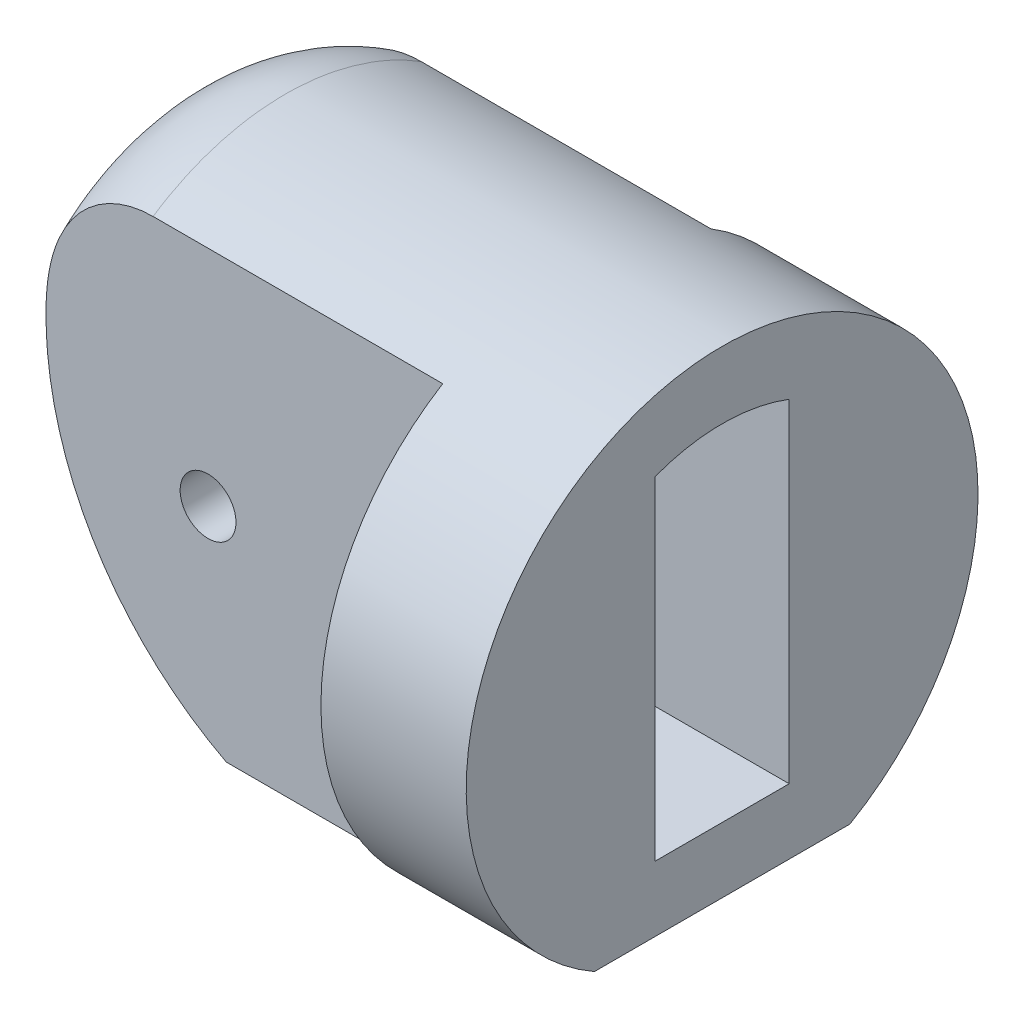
ISO-10303-21;
HEADER;
FILE_DESCRIPTION(('STEP AP214'),'2;1');
FILE_NAME('part.step','',(''),(''),'','','');
FILE_SCHEMA(('AUTOMOTIVE_DESIGN { 1 0 10303 214 1 1 1 1 }'));
ENDSEC;
DATA;
#1=APPLICATION_CONTEXT('core data for automotive mechanical design processes');
#2=APPLICATION_PROTOCOL_DEFINITION('international standard','automotive_design',2000,#1);
#3=PRODUCT_CONTEXT('',#1,'mechanical');
#4=PRODUCT('Part','Part','',(#3));
#5=PRODUCT_RELATED_PRODUCT_CATEGORY('part','',(#4));
#6=PRODUCT_DEFINITION_FORMATION('','',#4);
#7=PRODUCT_DEFINITION_CONTEXT('part definition',#1,'design');
#8=PRODUCT_DEFINITION('design','',#6,#7);
#9=PRODUCT_DEFINITION_SHAPE('','',#8);
#10=(LENGTH_UNIT() NAMED_UNIT(*) SI_UNIT(.MILLI.,.METRE.));
#11=(NAMED_UNIT(*) PLANE_ANGLE_UNIT() SI_UNIT($,.RADIAN.));
#12=(NAMED_UNIT(*) SI_UNIT($,.STERADIAN.) SOLID_ANGLE_UNIT());
#13=UNCERTAINTY_MEASURE_WITH_UNIT(LENGTH_MEASURE(1.E-05),#10,'distance_accuracy_value','');
#14=(GEOMETRIC_REPRESENTATION_CONTEXT(3) GLOBAL_UNCERTAINTY_ASSIGNED_CONTEXT((#13)) GLOBAL_UNIT_ASSIGNED_CONTEXT((#10,
#11,#12)) REPRESENTATION_CONTEXT('',''));
#15=CARTESIAN_POINT('',(0.,0.,0.));
#16=DIRECTION('',(0.,0.,1.));
#17=DIRECTION('',(1.,0.,0.));
#18=AXIS2_PLACEMENT_3D('',#15,#16,#17);
#19=CARTESIAN_POINT('',(-25.,11.45,-11.45));
#20=DIRECTION('',(0.996194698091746,0.0871557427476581,0.));
#21=DIRECTION('',(-0.0871557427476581,0.996194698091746,0.));
#22=AXIS2_PLACEMENT_3D('',#19,#20,#21);
#23=PLANE('',#22);
#24=DIRECTION('',(0.,0.,1.));
#25=VECTOR('',#24,1.);
#26=CARTESIAN_POINT('',(-24.1944624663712,2.24266385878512,-11.45));
#27=LINE('',#26,#25);
#28=CARTESIAN_POINT('',(-24.1944624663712,2.24266385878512,2.99999999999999));
#29=VERTEX_POINT('',#28);
#30=CARTESIAN_POINT('',(-24.1944624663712,2.24266385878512,5.86757576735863));
#31=VERTEX_POINT('',#30);
#32=EDGE_CURVE('E196',#29,#31,#27,.T.);
#33=ORIENTED_EDGE('',*,*,#32,.T.);
#34=CARTESIAN_POINT('',(-23.9601291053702,-0.43577871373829,0.));
#35=DIRECTION('',(0.996194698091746,0.0871557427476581,0.));
#36=DIRECTION('',(-0.0871557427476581,0.996194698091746,0.));
#37=AXIS2_PLACEMENT_3D('',#34,#35,#36);
#38=ELLIPSE('',#37,6.47463795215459,6.45);
#39=CARTESIAN_POINT('',(-24.4596771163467,5.27408117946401,2.99999999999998));
#40=VERTEX_POINT('',#39);
#41=EDGE_CURVE('E256',#31,#40,#38,.F.);
#42=ORIENTED_EDGE('',*,*,#41,.T.);
#43=DIRECTION('',(0.0871557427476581,-0.996194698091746,0.));
#44=VECTOR('',#43,1.);
#45=CARTESIAN_POINT('',(-25.,11.45,2.99999999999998));
#46=LINE('',#45,#44);
#47=EDGE_CURVE('E170',#40,#29,#46,.T.);
#48=ORIENTED_EDGE('',*,*,#47,.T.);
#49=EDGE_LOOP('',(#33,#42,#48));
#50=FACE_BOUND('',#49,.T.);
#51=ADVANCED_FACE('F36',(#50),#23,.F.);
#52=CARTESIAN_POINT('',(-17.,-0.247948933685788,-11.45));
#53=DIRECTION('',(0.,0.,1.));
#54=DIRECTION('',(1.,0.,0.));
#55=AXIS2_PLACEMENT_3D('',#52,#53,#54);
#56=CYLINDRICAL_SURFACE('',#55,1.25);
#57=CARTESIAN_POINT('',(-17.,-0.247948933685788,-3.));
#58=DIRECTION('',(0.,0.,-1.));
#59=DIRECTION('',(0.,1.,0.));
#60=AXIS2_PLACEMENT_3D('',#57,#58,#59);
#61=CIRCLE('',#60,1.25);
#62=CARTESIAN_POINT('',(-17.,1.00205106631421,-3.));
#63=VERTEX_POINT('',#62);
#64=EDGE_CURVE('E176',#63,#63,#61,.F.);
#65=ORIENTED_EDGE('',*,*,#64,.T.);
#66=EDGE_LOOP('',(#65));
#67=FACE_BOUND('',#66,.T.);
#68=CARTESIAN_POINT('',(-17.,-0.247948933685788,-6.));
#69=DIRECTION('',(0.,0.,1.));
#70=DIRECTION('',(1.,0.,0.));
#71=AXIS2_PLACEMENT_3D('',#68,#69,#70);
#72=CIRCLE('',#71,1.25);
#73=CARTESIAN_POINT('',(-15.75,-0.247948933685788,-6.));
#74=VERTEX_POINT('',#73);
#75=EDGE_CURVE('E192',#74,#74,#72,.T.);
#76=ORIENTED_EDGE('',*,*,#75,.F.);
#77=EDGE_LOOP('',(#76));
#78=FACE_BOUND('',#77,.T.);
#79=ADVANCED_FACE('F218',(#67,#78),#56,.F.);
#80=CARTESIAN_POINT('',(20.,0.,0.));
#81=DIRECTION('',(-1.,0.,0.));
#82=DIRECTION('',(0.,0.,1.));
#83=AXIS2_PLACEMENT_3D('',#80,#81,#82);
#84=CYLINDRICAL_SURFACE('',#83,11.45);
#85=CARTESIAN_POINT('',(32.4512624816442,0.,0.));
#86=DIRECTION('',(-0.292371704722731,0.956304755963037,0.));
#87=DIRECTION('',(-0.956304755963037,-0.292371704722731,0.));
#88=AXIS2_PLACEMENT_3D('',#85,#86,#87);
#89=ELLIPSE('',#88,39.1624764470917,11.45);
#90=CARTESIAN_POINT('',(-0.257263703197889,-10.,5.57696153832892));
#91=VERTEX_POINT('',#90);
#92=CARTESIAN_POINT('',(0.,-9.92134659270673,5.71571358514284));
#93=VERTEX_POINT('',#92);
#94=EDGE_CURVE('E424',#91,#93,#89,.T.);
#95=ORIENTED_EDGE('',*,*,#94,.T.);
#96=CARTESIAN_POINT('',(0.,0.,0.));
#97=DIRECTION('',(-1.,0.,0.));
#98=DIRECTION('',(0.,0.,1.));
#99=AXIS2_PLACEMENT_3D('',#96,#97,#98);
#100=CIRCLE('',#99,11.45);
#101=CARTESIAN_POINT('',(0.,-9.92134659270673,-5.71571358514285));
#102=VERTEX_POINT('',#101);
#103=EDGE_CURVE('E52',#93,#102,#100,.T.);
#104=ORIENTED_EDGE('',*,*,#103,.T.);
#105=CARTESIAN_POINT('',(-0.257263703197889,-10.,-5.57696153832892));
#106=VERTEX_POINT('',#105);
#107=EDGE_CURVE('E419',#102,#106,#89,.T.);
#108=ORIENTED_EDGE('',*,*,#107,.T.);
#109=DIRECTION('',(-1.,0.,0.));
#110=VECTOR('',#109,1.);
#111=CARTESIAN_POINT('',(20.,-10.,-5.57696153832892));
#112=LINE('',#111,#110);
#113=CARTESIAN_POINT('',(-15.6856308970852,-10.,-5.57696153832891));
#114=VERTEX_POINT('',#113);
#115=EDGE_CURVE('E186',#106,#114,#112,.T.);
#116=ORIENTED_EDGE('',*,*,#115,.T.);
#117=CARTESIAN_POINT('',(-24.1944624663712,2.24266385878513,-11.2282215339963));
#118=CARTESIAN_POINT('',(-24.182569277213,2.10670241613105,-11.255379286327));
#119=CARTESIAN_POINT('',(-24.1687742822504,1.97042587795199,-11.2800281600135));
#120=CARTESIAN_POINT('',(-24.1373449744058,1.69750639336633,-11.3243137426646));
#121=CARTESIAN_POINT('',(-24.1197107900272,1.56086345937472,-11.3439506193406));
#122=CARTESIAN_POINT('',(-24.0610245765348,1.15097698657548,-11.3953277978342));
#123=CARTESIAN_POINT('',(-24.0141707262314,0.877566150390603,-11.4195763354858));
#124=CARTESIAN_POINT('',(-23.9055032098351,0.334799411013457,-11.4483088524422));
#125=CARTESIAN_POINT('',(-23.8437998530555,0.065428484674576,-11.4529340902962));
#126=CARTESIAN_POINT('',(-23.7056855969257,-0.469198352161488,-11.4435060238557));
#127=CARTESIAN_POINT('',(-23.6292735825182,-0.734453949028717,-11.4294513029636));
#128=CARTESIAN_POINT('',(-23.4626201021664,-1.25839821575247,-11.3836708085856));
#129=CARTESIAN_POINT('',(-23.372407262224,-1.51709921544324,-11.3519812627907));
#130=CARTESIAN_POINT('',(-23.1788877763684,-2.02704739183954,-11.2720993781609));
#131=CARTESIAN_POINT('',(-23.075575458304,-2.27829128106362,-11.2238998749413));
#132=CARTESIAN_POINT('',(-22.856745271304,-2.77230426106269,-11.1122028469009));
#133=CARTESIAN_POINT('',(-22.7412110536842,-3.0150614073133,-11.0486846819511));
#134=CARTESIAN_POINT('',(-22.4990993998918,-3.49084617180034,-10.9077077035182));
#135=CARTESIAN_POINT('',(-22.3725195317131,-3.72387163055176,-10.8302458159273));
#136=CARTESIAN_POINT('',(-22.060025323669,-4.2649573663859,-10.6312751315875));
#137=CARTESIAN_POINT('',(-21.8696577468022,-4.56839519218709,-10.5041405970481));
#138=CARTESIAN_POINT('',(-21.4726573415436,-5.15458309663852,-10.2292550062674));
#139=CARTESIAN_POINT('',(-21.2660193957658,-5.43732661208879,-10.0814974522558));
#140=CARTESIAN_POINT('',(-20.8385852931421,-5.98207459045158,-9.76811907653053));
#141=CARTESIAN_POINT('',(-20.6177703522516,-6.24405046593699,-9.60247434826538));
#142=CARTESIAN_POINT('',(-20.1643384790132,-6.74686917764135,-9.25610478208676));
#143=CARTESIAN_POINT('',(-19.9317211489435,-6.98771130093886,-9.07537943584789));
#144=CARTESIAN_POINT('',(-19.3648284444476,-7.53746084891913,-8.62892746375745));
#145=CARTESIAN_POINT('',(-19.0259282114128,-7.83682341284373,-8.35728698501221));
#146=CARTESIAN_POINT('',(-18.3328424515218,-8.39690925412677,-7.79436691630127));
#147=CARTESIAN_POINT('',(-17.9786512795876,-8.6576181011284,-7.50308005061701));
#148=CARTESIAN_POINT('',(-17.257612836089,-9.14219481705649,-6.90444091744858));
#149=CARTESIAN_POINT('',(-16.8907447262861,-9.36599816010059,-6.59706172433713));
#150=CARTESIAN_POINT('',(-16.1475762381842,-9.77760841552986,-5.97005120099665));
#151=CARTESIAN_POINT('',(-15.7712762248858,-9.9654167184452,-5.65042034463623));
#152=CARTESIAN_POINT('',(-14.896204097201,-10.357992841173,-4.90331656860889));
#153=CARTESIAN_POINT('',(-14.3948488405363,-10.5506769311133,-4.47249474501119));
#154=CARTESIAN_POINT('',(-13.3833582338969,-10.8795192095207,-3.59947486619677));
#155=CARTESIAN_POINT('',(-12.8732191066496,-11.0156524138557,-3.15727187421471));
#156=CARTESIAN_POINT('',(-11.8487025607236,-11.2327045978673,-2.26680512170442));
#157=CARTESIAN_POINT('',(-11.3343372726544,-11.3137472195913,-1.8185572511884));
#158=CARTESIAN_POINT('',(-10.3032405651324,-11.4220525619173,-0.918851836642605));
#159=CARTESIAN_POINT('',(-9.78651109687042,-11.4493536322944,-0.467396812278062));
#160=CARTESIAN_POINT('',(-9.26383947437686,-11.4499962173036,-0.0107441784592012));
#161=CARTESIAN_POINT('',(-9.25769071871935,-11.4499999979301,-0.00537207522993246));
#162=CARTESIAN_POINT('',(-9.25154199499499,-11.45,0.));
#163=B_SPLINE_CURVE_WITH_KNOTS('',3,(#117,#118,#119,#120,#121,#122,#123,#124,#125,#126,#127,
#128,#129,#130,#131,#132,#133,#134,#135,#136,#137,#138,#139,#140,#141,#142,#143,#144,#145,#146,
#147,#148,#149,#150,#151,#152,#153,#154,#155,#156,#157,#158,#159,#160,#161,#162),.UNSPECIFIED.,
.F.,.F.,(4,2,2,2,2,2,2,2,2,2,2,2,2,2,2,2,2,2,2,2,2,2,4),(0.,0.417394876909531,0.834775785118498,
1.66889650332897,2.49700249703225,3.32517129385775,4.15164500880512,4.97847782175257,
5.8064309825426,6.63456690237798,7.77318156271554,8.91215578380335,10.0526715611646,
11.1932257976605,12.7733902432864,14.3541431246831,15.93763115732,17.5210580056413,
19.583935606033,21.6477236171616,23.7068643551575,25.764535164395,25.7890300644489),.UNSPECIFIED.);
#164=CARTESIAN_POINT('',(-16.1837449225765,-9.75205106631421,-6.));
#165=VERTEX_POINT('',#164);
#166=EDGE_CURVE('E199',#114,#165,#163,.F.);
#167=ORIENTED_EDGE('',*,*,#166,.T.);
#168=DIRECTION('',(-1.,0.,0.));
#169=VECTOR('',#168,1.);
#170=CARTESIAN_POINT('',(20.,-9.75205106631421,-6.));
#171=LINE('',#170,#169);
#172=CARTESIAN_POINT('',(-6.5,-9.75205106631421,-6.));
#173=VERTEX_POINT('',#172);
#174=EDGE_CURVE('E438',#165,#173,#171,.F.);
#175=ORIENTED_EDGE('',*,*,#174,.T.);
#176=CARTESIAN_POINT('',(-6.5,0.,0.));
#177=DIRECTION('',(1.,0.,0.));
#178=DIRECTION('',(0.,0.,-1.));
#179=AXIS2_PLACEMENT_3D('',#176,#177,#178);
#180=CIRCLE('',#179,11.45);
#181=CARTESIAN_POINT('',(-6.5,9.75205106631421,-6.));
#182=VERTEX_POINT('',#181);
#183=EDGE_CURVE('E446',#173,#182,#180,.T.);
#184=ORIENTED_EDGE('',*,*,#183,.T.);
#185=DIRECTION('',(-1.,0.,0.));
#186=VECTOR('',#185,1.);
#187=CARTESIAN_POINT('',(20.,9.75205106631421,-6.));
#188=LINE('',#187,#186);
#189=CARTESIAN_POINT('',(-19.4597757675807,9.75205106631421,-6.));
#190=VERTEX_POINT('',#189);
#191=EDGE_CURVE('E440',#182,#190,#188,.T.);
#192=ORIENTED_EDGE('',*,*,#191,.T.);
#193=CARTESIAN_POINT('',(-18.9791556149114,0.,0.));
#194=DIRECTION('',(-0.998787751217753,-0.0492242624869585,0.));
#195=DIRECTION('',(-0.0492242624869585,0.998787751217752,0.));
#196=AXIS2_PLACEMENT_3D('',#193,#194,#195);
#197=ELLIPSE('',#196,11.4638970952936,11.45);
#198=CARTESIAN_POINT('',(-19.4597757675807,9.75205106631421,5.99999999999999));
#199=VERTEX_POINT('',#198);
#200=EDGE_CURVE('E243',#190,#199,#197,.F.);
#201=ORIENTED_EDGE('',*,*,#200,.T.);
#202=DIRECTION('',(-1.,0.,0.));
#203=VECTOR('',#202,1.);
#204=CARTESIAN_POINT('',(20.,9.75205106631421,5.99999999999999));
#205=LINE('',#204,#203);
#206=CARTESIAN_POINT('',(-6.5,9.75205106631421,6.));
#207=VERTEX_POINT('',#206);
#208=EDGE_CURVE('E432',#199,#207,#205,.F.);
#209=ORIENTED_EDGE('',*,*,#208,.T.);
#210=CARTESIAN_POINT('',(-6.5,0.,0.));
#211=DIRECTION('',(1.,0.,0.));
#212=DIRECTION('',(0.,0.,-1.));
#213=AXIS2_PLACEMENT_3D('',#210,#211,#212);
#214=CIRCLE('',#213,11.45);
#215=CARTESIAN_POINT('',(-6.5,-9.75205106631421,6.));
#216=VERTEX_POINT('',#215);
#217=EDGE_CURVE('E443',#207,#216,#214,.T.);
#218=ORIENTED_EDGE('',*,*,#217,.T.);
#219=DIRECTION('',(-1.,0.,0.));
#220=VECTOR('',#219,1.);
#221=CARTESIAN_POINT('',(20.,-9.75205106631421,5.99999999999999));
#222=LINE('',#221,#220);
#223=CARTESIAN_POINT('',(-16.1837449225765,-9.75205106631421,5.99999999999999));
#224=VERTEX_POINT('',#223);
#225=EDGE_CURVE('E435',#216,#224,#222,.T.);
#226=ORIENTED_EDGE('',*,*,#225,.T.);
#227=CARTESIAN_POINT('',(-24.1944624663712,2.24266385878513,11.2282215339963));
#228=CARTESIAN_POINT('',(-24.182569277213,2.10670241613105,11.255379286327));
#229=CARTESIAN_POINT('',(-24.1687742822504,1.97042587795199,11.2800281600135));
#230=CARTESIAN_POINT('',(-24.1373449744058,1.69750639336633,11.3243137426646));
#231=CARTESIAN_POINT('',(-24.1197107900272,1.56086345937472,11.3439506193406));
#232=CARTESIAN_POINT('',(-24.0610245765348,1.15097698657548,11.3953277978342));
#233=CARTESIAN_POINT('',(-24.0141707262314,0.877566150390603,11.4195763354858));
#234=CARTESIAN_POINT('',(-23.9055032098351,0.334799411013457,11.4483088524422));
#235=CARTESIAN_POINT('',(-23.8437998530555,0.065428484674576,11.4529340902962));
#236=CARTESIAN_POINT('',(-23.7056855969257,-0.469198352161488,11.4435060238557));
#237=CARTESIAN_POINT('',(-23.6292735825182,-0.734453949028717,11.4294513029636));
#238=CARTESIAN_POINT('',(-23.4626201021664,-1.25839821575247,11.3836708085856));
#239=CARTESIAN_POINT('',(-23.372407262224,-1.51709921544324,11.3519812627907));
#240=CARTESIAN_POINT('',(-23.1788877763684,-2.02704739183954,11.2720993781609));
#241=CARTESIAN_POINT('',(-23.075575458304,-2.27829128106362,11.2238998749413));
#242=CARTESIAN_POINT('',(-22.856745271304,-2.77230426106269,11.1122028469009));
#243=CARTESIAN_POINT('',(-22.7412110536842,-3.0150614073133,11.0486846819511));
#244=CARTESIAN_POINT('',(-22.4990993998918,-3.49084617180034,10.9077077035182));
#245=CARTESIAN_POINT('',(-22.3725195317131,-3.72387163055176,10.8302458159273));
#246=CARTESIAN_POINT('',(-22.060025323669,-4.2649573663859,10.6312751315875));
#247=CARTESIAN_POINT('',(-21.8696577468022,-4.56839519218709,10.5041405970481));
#248=CARTESIAN_POINT('',(-21.4726573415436,-5.15458309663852,10.2292550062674));
#249=CARTESIAN_POINT('',(-21.2660193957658,-5.43732661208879,10.0814974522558));
#250=CARTESIAN_POINT('',(-20.8385852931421,-5.98207459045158,9.76811907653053));
#251=CARTESIAN_POINT('',(-20.6177703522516,-6.24405046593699,9.60247434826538));
#252=CARTESIAN_POINT('',(-20.1643384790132,-6.74686917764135,9.25610478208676));
#253=CARTESIAN_POINT('',(-19.9317211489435,-6.98771130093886,9.07537943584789));
#254=CARTESIAN_POINT('',(-19.3648284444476,-7.53746084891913,8.62892746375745));
#255=CARTESIAN_POINT('',(-19.0259282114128,-7.83682341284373,8.35728698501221));
#256=CARTESIAN_POINT('',(-18.3328424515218,-8.39690925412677,7.79436691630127));
#257=CARTESIAN_POINT('',(-17.9786512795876,-8.6576181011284,7.50308005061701));
#258=CARTESIAN_POINT('',(-17.257612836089,-9.14219481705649,6.90444091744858));
#259=CARTESIAN_POINT('',(-16.8907447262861,-9.36599816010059,6.59706172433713));
#260=CARTESIAN_POINT('',(-16.1475762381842,-9.77760841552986,5.97005120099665));
#261=CARTESIAN_POINT('',(-15.7712762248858,-9.9654167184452,5.65042034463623));
#262=CARTESIAN_POINT('',(-14.896204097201,-10.357992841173,4.90331656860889));
#263=CARTESIAN_POINT('',(-14.3948488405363,-10.5506769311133,4.47249474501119));
#264=CARTESIAN_POINT('',(-13.3833582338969,-10.8795192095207,3.59947486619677));
#265=CARTESIAN_POINT('',(-12.8732191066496,-11.0156524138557,3.15727187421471));
#266=CARTESIAN_POINT('',(-11.8487025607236,-11.2327045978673,2.26680512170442));
#267=CARTESIAN_POINT('',(-11.3343372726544,-11.3137472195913,1.8185572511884));
#268=CARTESIAN_POINT('',(-10.3032405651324,-11.4220525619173,0.918851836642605));
#269=CARTESIAN_POINT('',(-9.78651109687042,-11.4493536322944,0.467396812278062));
#270=CARTESIAN_POINT('',(-9.26383947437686,-11.4499962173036,0.0107441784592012));
#271=CARTESIAN_POINT('',(-9.25769071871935,-11.4499999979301,0.00537207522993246));
#272=CARTESIAN_POINT('',(-9.25154199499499,-11.45,0.));
#273=B_SPLINE_CURVE_WITH_KNOTS('',3,(#227,#228,#229,#230,#231,#232,#233,#234,#235,#236,#237,
#238,#239,#240,#241,#242,#243,#244,#245,#246,#247,#248,#249,#250,#251,#252,#253,#254,#255,#256,
#257,#258,#259,#260,#261,#262,#263,#264,#265,#266,#267,#268,#269,#270,#271,#272),.UNSPECIFIED.,
.F.,.F.,(4,2,2,2,2,2,2,2,2,2,2,2,2,2,2,2,2,2,2,2,2,2,4),(0.,0.417394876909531,0.834775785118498,
1.66889650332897,2.49700249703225,3.32517129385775,4.15164500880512,4.97847782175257,
5.8064309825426,6.63456690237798,7.77318156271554,8.91215578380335,10.0526715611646,
11.1932257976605,12.7733902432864,14.3541431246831,15.93763115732,17.5210580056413,
19.583935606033,21.6477236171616,23.7068643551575,25.764535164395,25.7890300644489),.UNSPECIFIED.);
#274=CARTESIAN_POINT('',(-15.6856308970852,-10.,5.57696153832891));
#275=VERTEX_POINT('',#274);
#276=EDGE_CURVE('E205',#224,#275,#273,.T.);
#277=ORIENTED_EDGE('',*,*,#276,.T.);
#278=DIRECTION('',(-1.,0.,0.));
#279=VECTOR('',#278,1.);
#280=CARTESIAN_POINT('',(20.,-10.,5.57696153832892));
#281=LINE('',#280,#279);
#282=EDGE_CURVE('E183',#275,#91,#281,.F.);
#283=ORIENTED_EDGE('',*,*,#282,.T.);
#284=EDGE_LOOP('',(#95,#104,#108,#116,#167,#175,#184,#192,#201,#209,#218,#226,#277,#283));
#285=FACE_BOUND('',#284,.T.);
#286=ADVANCED_FACE('F213',(#285),#84,.T.);
#287=CARTESIAN_POINT('',(12.9237170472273,-5.97016977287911,-11.45));
#288=DIRECTION('',(-0.292371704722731,0.956304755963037,0.));
#289=DIRECTION('',(-0.956304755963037,-0.292371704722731,0.));
#290=AXIS2_PLACEMENT_3D('',#287,#288,#289);
#291=PLANE('',#290);
#292=ORIENTED_EDGE('',*,*,#107,.F.);
#293=DIRECTION('',(0.,0.,1.));
#294=VECTOR('',#293,1.);
#295=CARTESIAN_POINT('',(0.,-9.92134659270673,-11.45));
#296=LINE('',#295,#294);
#297=EDGE_CURVE('E166',#102,#93,#296,.T.);
#298=ORIENTED_EDGE('',*,*,#297,.T.);
#299=ORIENTED_EDGE('',*,*,#94,.F.);
#300=DIRECTION('',(0.,0.,-1.));
#301=VECTOR('',#300,1.);
#302=CARTESIAN_POINT('',(-0.257263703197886,-10.,-11.45));
#303=LINE('',#302,#301);
#304=EDGE_CURVE('E189',#91,#106,#303,.T.);
#305=ORIENTED_EDGE('',*,*,#304,.T.);
#306=EDGE_LOOP('',(#292,#298,#299,#305));
#307=FACE_BOUND('',#306,.T.);
#308=ADVANCED_FACE('F217',(#307),#291,.F.);
#309=CARTESIAN_POINT('',(-25.,-11.45,6.));
#310=DIRECTION('',(0.,0.,-1.));
#311=DIRECTION('',(-1.,0.,0.));
#312=AXIS2_PLACEMENT_3D('',#309,#310,#311);
#313=PLANE('',#312);
#314=CARTESIAN_POINT('',(-17.,-0.247948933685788,6.));
#315=DIRECTION('',(0.,0.,-1.));
#316=DIRECTION('',(-1.,0.,0.));
#317=AXIS2_PLACEMENT_3D('',#314,#315,#316);
#318=CIRCLE('',#317,1.25);
#319=CARTESIAN_POINT('',(-18.25,-0.247948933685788,6.));
#320=VERTEX_POINT('',#319);
#321=EDGE_CURVE('E193',#320,#320,#318,.T.);
#322=ORIENTED_EDGE('',*,*,#321,.T.);
#323=EDGE_LOOP('',(#322));
#324=FACE_BOUND('',#323,.T.);
#325=ORIENTED_EDGE('',*,*,#208,.F.);
#326=CARTESIAN_POINT('',(-24.5244309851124,6.01422128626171,0.));
#327=CARTESIAN_POINT('',(-25.,11.45,0.));
#328=CARTESIAN_POINT('',(-19.5434574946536,11.45,0.));
#329=CARTESIAN_POINT('',(-24.5244309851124,6.01422128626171,0.28143997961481));
#330=CARTESIAN_POINT('',(-25.,11.45,0.520440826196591));
#331=CARTESIAN_POINT('',(-19.5434574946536,11.45,0.499610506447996));
#332=CARTESIAN_POINT('',(-24.5228170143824,5.9957735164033,0.562879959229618));
#333=CARTESIAN_POINT('',(-24.9968964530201,11.4145262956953,1.04073952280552));
#334=CARTESIAN_POINT('',(-19.5418435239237,11.4172516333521,0.999221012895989));
#335=CARTESIAN_POINT('',(-24.5163891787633,5.9223030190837,1.12094399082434));
#336=CARTESIAN_POINT('',(-24.9845439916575,11.2733370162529,2.07155251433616));
#337=CARTESIAN_POINT('',(-19.5354156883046,11.2868272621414,1.98989282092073));
#338=CARTESIAN_POINT('',(-24.5115749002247,5.86727556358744,1.39756741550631));
#339=CARTESIAN_POINT('',(-24.9753009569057,11.1676886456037,2.58179243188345));
#340=CARTESIAN_POINT('',(-19.530601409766,11.1891428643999,2.48095300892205));
#341=CARTESIAN_POINT('',(-24.4988292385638,5.7215919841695,1.94126612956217));
#342=CARTESIAN_POINT('',(-24.9508644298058,10.8883778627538,3.58266956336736));
#343=CARTESIAN_POINT('',(-19.5178557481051,10.9305262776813,3.44612359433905));
#344=CARTESIAN_POINT('',(-24.4908970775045,5.63092696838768,2.20833901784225));
#345=CARTESIAN_POINT('',(-24.9356822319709,10.7148445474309,4.07306123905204));
#346=CARTESIAN_POINT('',(-19.5099235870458,10.769578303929,3.92022972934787));
#347=CARTESIAN_POINT('',(-24.4720517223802,5.41552357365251,2.72836899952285));
#348=CARTESIAN_POINT('',(-24.8996886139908,10.3034356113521,5.02493096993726));
#349=CARTESIAN_POINT('',(-19.4910782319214,10.3871955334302,4.84338372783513));
#350=CARTESIAN_POINT('',(-24.4611374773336,5.2907731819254,2.98132107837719));
#351=CARTESIAN_POINT('',(-24.8788930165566,10.0657408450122,5.4862089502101));
#352=CARTESIAN_POINT('',(-19.4801639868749,10.1657394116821,5.29242268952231));
#353=CARTESIAN_POINT('',(-24.4365149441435,5.00933633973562,3.4687841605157));
#354=CARTESIAN_POINT('',(-24.8321090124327,9.53099723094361,6.37127845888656));
#355=CARTESIAN_POINT('',(-19.4555414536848,9.66613447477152,6.15776412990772));
#356=CARTESIAN_POINT('',(-24.4228054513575,4.85263612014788,3.70328715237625));
#357=CARTESIAN_POINT('',(-24.8061397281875,9.23416695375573,6.79492838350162));
#358=CARTESIAN_POINT('',(-19.4418319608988,9.38796121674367,6.57405238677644));
#359=CARTESIAN_POINT('',(-24.3928271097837,4.50998210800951,4.14984271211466));
#360=CARTESIAN_POINT('',(-24.7495453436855,8.58729017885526,7.59710103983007));
#361=CARTESIAN_POINT('',(-19.411853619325,8.77968393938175,7.36677504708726));
#362=CARTESIAN_POINT('',(-24.3765570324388,4.32401427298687,4.36188442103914));
#363=CARTESIAN_POINT('',(-24.7189412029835,8.23748324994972,7.97554911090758));
#364=CARTESIAN_POINT('',(-19.3955835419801,8.44955499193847,7.74319017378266));
#365=CARTESIAN_POINT('',(-24.3417358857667,3.92600674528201,4.75989208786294));
#366=CARTESIAN_POINT('',(-24.6536976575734,7.49174611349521,8.68076008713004));
#367=CARTESIAN_POINT('',(-19.3607623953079,7.74301449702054,8.44973091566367));
#368=CARTESIAN_POINT('',(-24.3231836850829,3.71395412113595,4.94584501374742));
#369=CARTESIAN_POINT('',(-24.6190794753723,7.09605848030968,9.00751872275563));
#370=CARTESIAN_POINT('',(-19.3422101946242,7.36657999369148,8.77983339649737));
#371=CARTESIAN_POINT('',(-24.2841155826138,3.26740366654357,5.2884953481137));
#372=CARTESIAN_POINT('',(-24.5464935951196,6.26639807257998,9.60398035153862));
#373=CARTESIAN_POINT('',(-19.303142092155,6.57386639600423,9.38810414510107));
#374=CARTESIAN_POINT('',(-24.2635987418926,3.0328951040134,5.44517866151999));
#375=CARTESIAN_POINT('',(-24.508545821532,5.83265303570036,9.87374784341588));
#376=CARTESIAN_POINT('',(-19.2826252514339,6.15756825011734,9.66624739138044));
#377=CARTESIAN_POINT('',(-24.2209521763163,2.54544262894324,5.72660957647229));
#378=CARTESIAN_POINT('',(-24.4300330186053,4.93524759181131,10.3521040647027));
#379=CARTESIAN_POINT('',(-19.2399786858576,5.29224563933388,10.1658418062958));
#380=CARTESIAN_POINT('',(-24.1988217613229,2.29249082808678,5.85134340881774));
#381=CARTESIAN_POINT('',(-24.3894851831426,4.47178371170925,10.5608197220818));
#382=CARTESIAN_POINT('',(-19.2178482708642,4.84320717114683,10.3872685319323));
#383=CARTESIAN_POINT('',(-24.1533264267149,1.77247677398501,6.06674035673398));
#384=CARTESIAN_POINT('',(-24.3065328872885,3.52363463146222,10.9142155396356));
#385=CARTESIAN_POINT('',(-19.1723529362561,3.92008144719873,10.7696398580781));
#386=CARTESIAN_POINT('',(-24.1299610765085,1.50540959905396,6.1573914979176));
#387=CARTESIAN_POINT('',(-24.2641416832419,3.03910095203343,11.0590746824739));
#388=CARTESIAN_POINT('',(-19.1489875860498,3.44598545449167,10.9305632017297));
#389=CARTESIAN_POINT('',(-24.0823953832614,0.961731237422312,6.30306972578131));
#390=CARTESIAN_POINT('',(-24.1782747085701,2.05763694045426,11.2831513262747));
#391=CARTESIAN_POINT('',(-19.1014218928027,2.48085099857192,11.1891702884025));
#392=CARTESIAN_POINT('',(-24.0581948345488,0.68511769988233,6.35808797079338));
#393=CARTESIAN_POINT('',(-24.134807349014,1.56080274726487,11.3625863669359));
#394=CARTESIAN_POINT('',(-19.0772213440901,1.98980836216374,11.2868383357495));
#395=CARTESIAN_POINT('',(-24.0093725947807,0.127076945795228,6.43155545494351));
#396=CARTESIAN_POINT('',(-24.0475562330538,0.563517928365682,11.4554155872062));
#397=CARTESIAN_POINT('',(-19.028399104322,0.999177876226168,11.4172573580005));
#398=CARTESIAN_POINT('',(-23.9847508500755,-0.154350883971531,6.45));
#399=CARTESIAN_POINT('',(-24.0037754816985,0.0631016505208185,11.4690502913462));
#400=CARTESIAN_POINT('',(-19.0037773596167,0.499588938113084,11.45));
#401=CARTESIAN_POINT('',(-23.9355073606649,-0.717206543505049,6.45));
#402=CARTESIAN_POINT('',(-23.9166483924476,-0.932765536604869,11.4310220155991));
#403=CARTESIAN_POINT('',(-18.9545338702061,-0.499588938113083,11.45));
#404=CARTESIAN_POINT('',(-23.9108856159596,-0.998634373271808,6.43155545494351));
#405=CARTESIAN_POINT('',(-23.8732994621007,-1.42824607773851,11.3796059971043));
#406=CARTESIAN_POINT('',(-18.9299121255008,-0.999177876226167,11.4172573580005));
#407=CARTESIAN_POINT('',(-23.8620633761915,-1.55667512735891,6.35808797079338));
#408=CARTESIAN_POINT('',(-23.7877578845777,-2.40599078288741,11.2132828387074));
#409=CARTESIAN_POINT('',(-18.8810898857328,-1.98980836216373,11.2868383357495));
#410=CARTESIAN_POINT('',(-23.8378628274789,-1.83328866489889,6.30306972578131));
#411=CARTESIAN_POINT('',(-23.7455572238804,-2.88834654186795,11.0986126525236));
#412=CARTESIAN_POINT('',(-18.8568893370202,-2.48085099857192,11.1891702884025));
#413=CARTESIAN_POINT('',(-23.7902971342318,-2.37696702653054,6.1573914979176));
#414=CARTESIAN_POINT('',(-23.6629953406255,-3.83203318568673,10.8085629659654));
#415=CARTESIAN_POINT('',(-18.8093236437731,-3.44598545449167,10.9305632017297));
#416=CARTESIAN_POINT('',(-23.7669317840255,-2.64403420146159,6.06674035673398));
#417=CARTESIAN_POINT('',(-23.6226212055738,-4.29351166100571,10.6333950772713));
#418=CARTESIAN_POINT('',(-18.7859582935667,-3.92008144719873,10.7696398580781));
#419=CARTESIAN_POINT('',(-23.7214364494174,-3.16404825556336,5.85134340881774));
#420=CARTESIAN_POINT('',(-23.5443486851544,-5.18817066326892,10.2260139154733));
#421=CARTESIAN_POINT('',(-18.7404629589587,-4.84320717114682,10.3872685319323));
#422=CARTESIAN_POINT('',(-23.699306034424,-3.41700005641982,5.7266095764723));
#423=CARTESIAN_POINT('',(-23.5064333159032,-5.62154531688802,9.99397358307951));
#424=CARTESIAN_POINT('',(-18.7183325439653,-5.29224563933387,10.1658418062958));
#425=CARTESIAN_POINT('',(-23.6566594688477,-3.90445253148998,5.44517866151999));
#426=CARTESIAN_POINT('',(-23.4336611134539,-6.4533353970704,9.47729845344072));
#427=CARTESIAN_POINT('',(-18.675685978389,-6.15756825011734,9.66624739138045));
#428=CARTESIAN_POINT('',(-23.6361426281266,-4.13896109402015,5.2884953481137));
#429=CARTESIAN_POINT('',(-23.3987843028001,-6.85197916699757,9.19278735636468));
#430=CARTESIAN_POINT('',(-18.6551691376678,-6.57386639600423,9.38810414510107));
#431=CARTESIAN_POINT('',(-23.5970745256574,-4.58551154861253,4.94584501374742));
#432=CARTESIAN_POINT('',(-23.3326130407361,-7.60832015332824,8.5763134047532));
#433=CARTESIAN_POINT('',(-18.6161010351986,-7.36657999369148,8.77983339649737));
#434=CARTESIAN_POINT('',(-23.5785223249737,-4.79756417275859,4.75989208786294));
#435=CARTESIAN_POINT('',(-23.3012968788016,-7.96626552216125,8.24441778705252));
#436=CARTESIAN_POINT('',(-18.5975488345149,-7.74301449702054,8.44973091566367));
#437=CARTESIAN_POINT('',(-23.5437011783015,-5.19557170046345,4.36188442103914));
#438=CARTESIAN_POINT('',(-23.2427073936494,-8.63594640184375,7.53891514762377));
#439=CARTESIAN_POINT('',(-18.5627276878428,-8.44955499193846,7.74319017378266));
#440=CARTESIAN_POINT('',(-23.5274311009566,-5.38153953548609,4.14984271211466));
#441=CARTESIAN_POINT('',(-23.215411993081,-8.94793425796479,7.16531542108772));
#442=CARTESIAN_POINT('',(-18.5464576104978,-8.77968393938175,7.36677504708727));
#443=CARTESIAN_POINT('',(-23.4974527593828,-5.72419354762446,3.70328715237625));
#444=CARTESIAN_POINT('',(-23.1652576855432,-9.52120061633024,6.38265003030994));
#445=CARTESIAN_POINT('',(-18.5164792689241,-9.38796121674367,6.57405238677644));
#446=CARTESIAN_POINT('',(-23.4837432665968,-5.8808937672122,3.4687841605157));
#447=CARTESIAN_POINT('',(-23.1423777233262,-9.78271978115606,5.97353217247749));
#448=CARTESIAN_POINT('',(-18.5027697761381,-9.66613447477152,6.15776412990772));
#449=CARTESIAN_POINT('',(-23.4591207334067,-6.16233060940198,2.98132107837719));
#450=CARTESIAN_POINT('',(-23.1013784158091,-10.2513440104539,5.12649035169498));
#451=CARTESIAN_POINT('',(-18.478147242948,-10.1657394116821,5.29242268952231));
#452=CARTESIAN_POINT('',(-23.4482064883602,-6.28708100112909,2.72836899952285));
#453=CARTESIAN_POINT('',(-23.0832403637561,-10.4586628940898,4.68845904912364));
#454=CARTESIAN_POINT('',(-18.4672329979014,-10.3871955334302,4.84338372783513));
#455=CARTESIAN_POINT('',(-23.4293611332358,-6.50248439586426,2.20833901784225));
#456=CARTESIAN_POINT('',(-23.051977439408,-10.815999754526,3.79057555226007));
#457=CARTESIAN_POINT('',(-18.4483876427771,-10.769578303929,3.92022972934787));
#458=CARTESIAN_POINT('',(-23.4214289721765,-6.59314941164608,1.94126612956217));
#459=CARTESIAN_POINT('',(-23.0388373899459,-10.9661912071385,3.33056882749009));
#460=CARTESIAN_POINT('',(-18.4404554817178,-10.9305262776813,3.44612359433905));
#461=CARTESIAN_POINT('',(-23.4086833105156,-6.73883299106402,1.39756741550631));
#462=CARTESIAN_POINT('',(-23.0177500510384,-11.2072205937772,2.39595774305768));
#463=CARTESIAN_POINT('',(-18.4277098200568,-11.1891428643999,2.48095300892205));
#464=CARTESIAN_POINT('',(-23.403869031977,-6.79386044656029,1.12094399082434));
#465=CARTESIAN_POINT('',(-23.0097920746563,-11.2981806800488,1.92116272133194));
#466=CARTESIAN_POINT('',(-18.4228955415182,-11.2868272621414,1.98989282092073));
#467=CARTESIAN_POINT('',(-23.3974411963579,-6.86733094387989,0.56287995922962));
#468=CARTESIAN_POINT('',(-22.9991746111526,-11.4195388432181,0.964350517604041));
#469=CARTESIAN_POINT('',(-18.4164677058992,-11.4172516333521,0.999221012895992));
#470=CARTESIAN_POINT('',(-23.395827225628,-6.88577871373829,0.28143997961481));
#471=CARTESIAN_POINT('',(-22.9965096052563,-11.45,0.482119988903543));
#472=CARTESIAN_POINT('',(-18.4148537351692,-11.45,0.499610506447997));
#473=CARTESIAN_POINT('',(-23.395827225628,-6.88577871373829,-0.281439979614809));
#474=CARTESIAN_POINT('',(-22.9965096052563,-11.45,-0.48211998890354));
#475=CARTESIAN_POINT('',(-18.4148537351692,-11.45,-0.499610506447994));
#476=CARTESIAN_POINT('',(-23.3974411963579,-6.86733094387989,-0.562879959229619));
#477=CARTESIAN_POINT('',(-22.9991746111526,-11.4195388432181,-0.964350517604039));
#478=CARTESIAN_POINT('',(-18.4164677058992,-11.4172516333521,-0.99922101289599));
#479=CARTESIAN_POINT('',(-23.403869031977,-6.79386044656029,-1.12094399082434));
#480=CARTESIAN_POINT('',(-23.0097920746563,-11.2981806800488,-1.92116272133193));
#481=CARTESIAN_POINT('',(-18.4228955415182,-11.2868272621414,-1.98989282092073));
#482=CARTESIAN_POINT('',(-23.4086833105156,-6.73883299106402,-1.39756741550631));
#483=CARTESIAN_POINT('',(-23.0177500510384,-11.2072205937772,-2.39595774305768));
#484=CARTESIAN_POINT('',(-18.4277098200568,-11.1891428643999,-2.48095300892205));
#485=CARTESIAN_POINT('',(-23.4214289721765,-6.59314941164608,-1.94126612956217));
#486=CARTESIAN_POINT('',(-23.0388373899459,-10.9661912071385,-3.33056882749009));
#487=CARTESIAN_POINT('',(-18.4404554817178,-10.9305262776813,-3.44612359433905));
#488=CARTESIAN_POINT('',(-23.4293611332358,-6.50248439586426,-2.20833901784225));
#489=CARTESIAN_POINT('',(-23.051977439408,-10.815999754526,-3.79057555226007));
#490=CARTESIAN_POINT('',(-18.4483876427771,-10.769578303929,-3.92022972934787));
#491=CARTESIAN_POINT('',(-23.4482064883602,-6.28708100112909,-2.72836899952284));
#492=CARTESIAN_POINT('',(-23.0832403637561,-10.4586628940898,-4.68845904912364));
#493=CARTESIAN_POINT('',(-18.4672329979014,-10.3871955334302,-4.84338372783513));
#494=CARTESIAN_POINT('',(-23.4591207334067,-6.16233060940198,-2.98132107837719));
#495=CARTESIAN_POINT('',(-23.1013784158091,-10.2513440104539,-5.12649035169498));
#496=CARTESIAN_POINT('',(-18.478147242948,-10.1657394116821,-5.2924226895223));
#497=CARTESIAN_POINT('',(-23.4837432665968,-5.8808937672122,-3.4687841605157));
#498=CARTESIAN_POINT('',(-23.1423777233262,-9.78271978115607,-5.97353217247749));
#499=CARTESIAN_POINT('',(-18.5027697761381,-9.66613447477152,-6.15776412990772));
#500=CARTESIAN_POINT('',(-23.4974527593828,-5.72419354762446,-3.70328715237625));
#501=CARTESIAN_POINT('',(-23.1652576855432,-9.52120061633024,-6.38265003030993));
#502=CARTESIAN_POINT('',(-18.5164792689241,-9.38796121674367,-6.57405238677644));
#503=CARTESIAN_POINT('',(-23.5274311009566,-5.38153953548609,-4.14984271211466));
#504=CARTESIAN_POINT('',(-23.215411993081,-8.94793425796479,-7.16531542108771));
#505=CARTESIAN_POINT('',(-18.5464576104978,-8.77968393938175,-7.36677504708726));
#506=CARTESIAN_POINT('',(-23.5437011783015,-5.19557170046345,-4.36188442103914));
#507=CARTESIAN_POINT('',(-23.2427073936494,-8.63594640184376,-7.53891514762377));
#508=CARTESIAN_POINT('',(-18.5627276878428,-8.44955499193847,-7.74319017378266));
#509=CARTESIAN_POINT('',(-23.5785223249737,-4.7975641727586,-4.75989208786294));
#510=CARTESIAN_POINT('',(-23.3012968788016,-7.96626552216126,-8.24441778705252));
#511=CARTESIAN_POINT('',(-18.5975488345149,-7.74301449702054,-8.44973091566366));
#512=CARTESIAN_POINT('',(-23.5970745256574,-4.58551154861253,-4.94584501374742));
#513=CARTESIAN_POINT('',(-23.3326130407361,-7.60832015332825,-8.5763134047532));
#514=CARTESIAN_POINT('',(-18.6161010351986,-7.36657999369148,-8.77983339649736));
#515=CARTESIAN_POINT('',(-23.6361426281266,-4.13896109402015,-5.2884953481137));
#516=CARTESIAN_POINT('',(-23.3987843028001,-6.85197916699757,-9.19278735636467));
#517=CARTESIAN_POINT('',(-18.6551691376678,-6.57386639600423,-9.38810414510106));
#518=CARTESIAN_POINT('',(-23.6566594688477,-3.90445253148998,-5.44517866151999));
#519=CARTESIAN_POINT('',(-23.4336611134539,-6.45333539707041,-9.47729845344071));
#520=CARTESIAN_POINT('',(-18.675685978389,-6.15756825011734,-9.66624739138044));
#521=CARTESIAN_POINT('',(-23.699306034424,-3.41700005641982,-5.72660957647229));
#522=CARTESIAN_POINT('',(-23.5064333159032,-5.62154531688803,-9.9939735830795));
#523=CARTESIAN_POINT('',(-18.7183325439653,-5.29224563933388,-10.1658418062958));
#524=CARTESIAN_POINT('',(-23.7214364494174,-3.16404825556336,-5.85134340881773));
#525=CARTESIAN_POINT('',(-23.5443486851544,-5.18817066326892,-10.2260139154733));
#526=CARTESIAN_POINT('',(-18.7404629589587,-4.84320717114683,-10.3872685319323));
#527=CARTESIAN_POINT('',(-23.7669317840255,-2.64403420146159,-6.06674035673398));
#528=CARTESIAN_POINT('',(-23.6226212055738,-4.29351166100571,-10.6333950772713));
#529=CARTESIAN_POINT('',(-18.7859582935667,-3.92008144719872,-10.7696398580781));
#530=CARTESIAN_POINT('',(-23.7902971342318,-2.37696702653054,-6.1573914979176));
#531=CARTESIAN_POINT('',(-23.6629953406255,-3.83203318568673,-10.8085629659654));
#532=CARTESIAN_POINT('',(-18.8093236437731,-3.44598545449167,-10.9305632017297));
#533=CARTESIAN_POINT('',(-23.8378628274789,-1.83328866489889,-6.30306972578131));
#534=CARTESIAN_POINT('',(-23.7455572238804,-2.88834654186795,-11.0986126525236));
#535=CARTESIAN_POINT('',(-18.8568893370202,-2.48085099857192,-11.1891702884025));
#536=CARTESIAN_POINT('',(-23.8620633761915,-1.55667512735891,-6.35808797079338));
#537=CARTESIAN_POINT('',(-23.7877578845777,-2.40599078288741,-11.2132828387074));
#538=CARTESIAN_POINT('',(-18.8810898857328,-1.98980836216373,-11.2868383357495));
#539=CARTESIAN_POINT('',(-23.9108856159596,-0.998634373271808,-6.43155545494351));
#540=CARTESIAN_POINT('',(-23.8732994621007,-1.42824607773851,-11.3796059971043));
#541=CARTESIAN_POINT('',(-18.9299121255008,-0.999177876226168,-11.4172573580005));
#542=CARTESIAN_POINT('',(-23.9355073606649,-0.71720654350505,-6.45));
#543=CARTESIAN_POINT('',(-23.9166483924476,-0.93276553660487,-11.4310220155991));
#544=CARTESIAN_POINT('',(-18.9545338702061,-0.499588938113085,-11.45));
#545=CARTESIAN_POINT('',(-23.9847508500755,-0.154350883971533,-6.45));
#546=CARTESIAN_POINT('',(-24.0037754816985,0.0631016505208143,-11.4690502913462));
#547=CARTESIAN_POINT('',(-19.0037773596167,0.499588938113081,-11.45));
#548=CARTESIAN_POINT('',(-24.0093725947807,0.127076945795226,-6.43155545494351));
#549=CARTESIAN_POINT('',(-24.0475562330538,0.563517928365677,-11.4554155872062));
#550=CARTESIAN_POINT('',(-19.028399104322,0.999177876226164,-11.4172573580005));
#551=CARTESIAN_POINT('',(-24.0581948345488,0.685117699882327,-6.35808797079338));
#552=CARTESIAN_POINT('',(-24.134807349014,1.56080274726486,-11.3625863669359));
#553=CARTESIAN_POINT('',(-19.0772213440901,1.98980836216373,-11.2868383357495));
#554=CARTESIAN_POINT('',(-24.0823953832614,0.961731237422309,-6.30306972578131));
#555=CARTESIAN_POINT('',(-24.1782747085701,2.05763694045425,-11.2831513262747));
#556=CARTESIAN_POINT('',(-19.1014218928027,2.48085099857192,-11.1891702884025));
#557=CARTESIAN_POINT('',(-24.1299610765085,1.50540959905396,-6.1573914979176));
#558=CARTESIAN_POINT('',(-24.2641416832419,3.03910095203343,-11.0590746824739));
#559=CARTESIAN_POINT('',(-19.1489875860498,3.44598545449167,-10.9305632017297));
#560=CARTESIAN_POINT('',(-24.1533264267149,1.77247677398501,-6.06674035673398));
#561=CARTESIAN_POINT('',(-24.3065328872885,3.52363463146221,-10.9142155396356));
#562=CARTESIAN_POINT('',(-19.1723529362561,3.92008144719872,-10.7696398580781));
#563=CARTESIAN_POINT('',(-24.1988217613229,2.29249082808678,-5.85134340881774));
#564=CARTESIAN_POINT('',(-24.3894851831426,4.47178371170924,-10.5608197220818));
#565=CARTESIAN_POINT('',(-19.2178482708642,4.84320717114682,-10.3872685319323));
#566=CARTESIAN_POINT('',(-24.2209521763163,2.54544262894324,-5.72660957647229));
#567=CARTESIAN_POINT('',(-24.4300330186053,4.93524759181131,-10.3521040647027));
#568=CARTESIAN_POINT('',(-19.2399786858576,5.29224563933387,-10.1658418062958));
#569=CARTESIAN_POINT('',(-24.2635987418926,3.0328951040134,-5.44517866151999));
#570=CARTESIAN_POINT('',(-24.508545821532,5.83265303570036,-9.87374784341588));
#571=CARTESIAN_POINT('',(-19.2826252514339,6.15756825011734,-9.66624739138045));
#572=CARTESIAN_POINT('',(-24.2841155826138,3.26740366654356,-5.2884953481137));
#573=CARTESIAN_POINT('',(-24.5464935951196,6.26639807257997,-9.60398035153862));
#574=CARTESIAN_POINT('',(-19.303142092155,6.57386639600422,-9.38810414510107));
#575=CARTESIAN_POINT('',(-24.3231836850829,3.71395412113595,-4.94584501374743));
#576=CARTESIAN_POINT('',(-24.6190794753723,7.09605848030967,-9.00751872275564));
#577=CARTESIAN_POINT('',(-19.3422101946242,7.36657999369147,-8.77983339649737));
#578=CARTESIAN_POINT('',(-24.3417358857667,3.92600674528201,-4.75989208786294));
#579=CARTESIAN_POINT('',(-24.6536976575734,7.4917461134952,-8.68076008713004));
#580=CARTESIAN_POINT('',(-19.3607623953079,7.74301449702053,-8.44973091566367));
#581=CARTESIAN_POINT('',(-24.3765570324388,4.32401427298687,-4.36188442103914));
#582=CARTESIAN_POINT('',(-24.7189412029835,8.23748324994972,-7.97554911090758));
#583=CARTESIAN_POINT('',(-19.3955835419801,8.44955499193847,-7.74319017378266));
#584=CARTESIAN_POINT('',(-24.3928271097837,4.50998210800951,-4.14984271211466));
#585=CARTESIAN_POINT('',(-24.7495453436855,8.58729017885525,-7.59710103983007));
#586=CARTESIAN_POINT('',(-19.411853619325,8.77968393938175,-7.36677504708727));
#587=CARTESIAN_POINT('',(-24.4228054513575,4.85263612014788,-3.70328715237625));
#588=CARTESIAN_POINT('',(-24.8061397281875,9.23416695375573,-6.79492838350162));
#589=CARTESIAN_POINT('',(-19.4418319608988,9.38796121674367,-6.57405238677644));
#590=CARTESIAN_POINT('',(-24.4365149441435,5.00933633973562,-3.46878416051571));
#591=CARTESIAN_POINT('',(-24.8321090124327,9.53099723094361,-6.37127845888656));
#592=CARTESIAN_POINT('',(-19.4555414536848,9.66613447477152,-6.15776412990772));
#593=CARTESIAN_POINT('',(-24.4611374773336,5.2907731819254,-2.9813210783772));
#594=CARTESIAN_POINT('',(-24.8788930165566,10.0657408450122,-5.4862089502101));
#595=CARTESIAN_POINT('',(-19.4801639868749,10.1657394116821,-5.29242268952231));
#596=CARTESIAN_POINT('',(-24.4720517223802,5.41552357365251,-2.72836899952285));
#597=CARTESIAN_POINT('',(-24.8996886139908,10.3034356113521,-5.02493096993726));
#598=CARTESIAN_POINT('',(-19.4910782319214,10.3871955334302,-4.84338372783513));
#599=CARTESIAN_POINT('',(-24.4908970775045,5.63092696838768,-2.20833901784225));
#600=CARTESIAN_POINT('',(-24.9356822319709,10.7148445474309,-4.07306123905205));
#601=CARTESIAN_POINT('',(-19.5099235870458,10.769578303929,-3.92022972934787));
#602=CARTESIAN_POINT('',(-24.4988292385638,5.7215919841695,-1.94126612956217));
#603=CARTESIAN_POINT('',(-24.9508644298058,10.8883778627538,-3.58266956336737));
#604=CARTESIAN_POINT('',(-19.5178557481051,10.9305262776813,-3.44612359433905));
#605=CARTESIAN_POINT('',(-24.5115749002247,5.86727556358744,-1.39756741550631));
#606=CARTESIAN_POINT('',(-24.9753009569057,11.1676886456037,-2.58179243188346));
#607=CARTESIAN_POINT('',(-19.530601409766,11.1891428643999,-2.48095300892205));
#608=CARTESIAN_POINT('',(-24.5163891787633,5.9223030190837,-1.12094399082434));
#609=CARTESIAN_POINT('',(-24.9845439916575,11.2733370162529,-2.07155251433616));
#610=CARTESIAN_POINT('',(-19.5354156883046,11.2868272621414,-1.98989282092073));
#611=CARTESIAN_POINT('',(-24.5228170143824,5.9957735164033,-0.562879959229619));
#612=CARTESIAN_POINT('',(-24.9968964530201,11.4145262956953,-1.04073952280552));
#613=CARTESIAN_POINT('',(-19.5418435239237,11.4172516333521,-0.99922101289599));
#614=CARTESIAN_POINT('',(-24.5244309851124,6.01422128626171,-0.281439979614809));
#615=CARTESIAN_POINT('',(-25.,11.45,-0.52044082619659));
#616=CARTESIAN_POINT('',(-19.5434574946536,11.45,-0.499610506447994));
#617=CARTESIAN_POINT('',(-24.5244309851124,6.01422128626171,0.));
#618=CARTESIAN_POINT('',(-25.,11.45,0.));
#619=CARTESIAN_POINT('',(-19.5434574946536,11.45,0.));
#620=(BOUNDED_SURFACE() B_SPLINE_SURFACE(3,2,((#326,#327,#328),(#329,#330,#331),(#332,#333,
#334),(#335,#336,#337),(#338,#339,#340),(#341,#342,#343),(#344,#345,#346),(#347,#348,#349),
(#350,#351,#352),(#353,#354,#355),(#356,#357,#358),(#359,#360,#361),(#362,#363,#364),(#365,#366,
#367),(#368,#369,#370),(#371,#372,#373),(#374,#375,#376),(#377,#378,#379),(#380,#381,#382),
(#383,#384,#385),(#386,#387,#388),(#389,#390,#391),(#392,#393,#394),(#395,#396,#397),(#398,#399,
#400),(#401,#402,#403),(#404,#405,#406),(#407,#408,#409),(#410,#411,#412),(#413,#414,#415),
(#416,#417,#418),(#419,#420,#421),(#422,#423,#424),(#425,#426,#427),(#428,#429,#430),(#431,#432,
#433),(#434,#435,#436),(#437,#438,#439),(#440,#441,#442),(#443,#444,#445),(#446,#447,#448),
(#449,#450,#451),(#452,#453,#454),(#455,#456,#457),(#458,#459,#460),(#461,#462,#463),(#464,#465,
#466),(#467,#468,#469),(#470,#471,#472),(#473,#474,#475),(#476,#477,#478),(#479,#480,#481),
(#482,#483,#484),(#485,#486,#487),(#488,#489,#490),(#491,#492,#493),(#494,#495,#496),(#497,#498,
#499),(#500,#501,#502),(#503,#504,#505),(#506,#507,#508),(#509,#510,#511),(#512,#513,#514),
(#515,#516,#517),(#518,#519,#520),(#521,#522,#523),(#524,#525,#526),(#527,#528,#529),(#530,#531,
#532),(#533,#534,#535),(#536,#537,#538),(#539,#540,#541),(#542,#543,#544),(#545,#546,#547),
(#548,#549,#550),(#551,#552,#553),(#554,#555,#556),(#557,#558,#559),(#560,#561,#562),(#563,#564,
#565),(#566,#567,#568),(#569,#570,#571),(#572,#573,#574),(#575,#576,#577),(#578,#579,#580),
(#581,#582,#583),(#584,#585,#586),(#587,#588,#589),(#590,#591,#592),(#593,#594,#595),(#596,#597,
#598),(#599,#600,#601),(#602,#603,#604),(#605,#606,#607),(#608,#609,#610),(#611,#612,#613),
(#614,#615,#616),(#617,#618,#619)),.UNSPECIFIED.,.T.,.F.,.F.) B_SPLINE_SURFACE_WITH_KNOTS((4,2,
2,2,2,2,2,2,2,2,2,2,2,2,2,2,2,2,2,2,2,2,2,2,2,2,2,2,2,2,2,2,2,2,2,2,2,2,2,2,2,2,2,2,2,2,2,2,4),
(3,3),(0.,0.843714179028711,1.68753743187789,2.53157135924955,3.37590313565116,4.22059955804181,
5.06570250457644,5.91122610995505,6.75715584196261,7.60344953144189,8.45004027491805,
9.29684100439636,10.1437504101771,10.9906598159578,11.8374605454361,12.6840512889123,
13.5303449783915,14.3762747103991,15.2217983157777,16.0669012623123,16.911597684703,
17.7559294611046,18.5999633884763,19.4437866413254,20.2875008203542,21.1312149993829,
21.975038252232,22.8190721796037,23.6634039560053,24.508100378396,25.3532033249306,
26.1987269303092,27.0446566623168,27.8909503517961,28.7375410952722,29.5843418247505,
30.4312512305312,31.278160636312,32.1249613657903,32.9715521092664,33.8178457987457,
34.6637755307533,35.5092991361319,36.3544020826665,37.1990985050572,38.0434302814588,
38.8874642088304,39.7312874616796,40.5750016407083),(0.,1.),
.UNSPECIFIED.) GEOMETRIC_REPRESENTATION_ITEM() RATIONAL_B_SPLINE_SURFACE(((1.,0.67559020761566,
1.),(1.,0.67559020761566,1.),(1.,0.675682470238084,1.),(1.,0.676049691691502,1.),(1.,
0.676324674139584,1.),(1.,0.677051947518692,1.),(1.,0.677504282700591,1.),(1.,0.678577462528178,
1.),(1.,0.679198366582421,1.),(1.,0.680596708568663,1.),(1.,0.681374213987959,1.),(1.,
0.683070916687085,1.),(1.,0.683990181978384,1.),(1.,0.685953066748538,1.),(1.,0.68699674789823,
1.),(1.,0.689189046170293,1.),(1.,0.690337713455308,1.),(1.,0.692718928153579,1.),(1.,
0.693951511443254,1.),(1.,0.69647831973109,1.),(1.,0.697772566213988,1.),(1.,0.700399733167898,
1.),(1.,0.701732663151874,1.),(1.,0.704413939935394,1.),(1.,0.70576228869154,1.),(1.,
0.708451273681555,1.),(1.,0.709791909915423,1.),(1.,0.712442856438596,1.),(1.,0.713753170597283,
1.),(1.,0.71632172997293,1.),(1.,0.717579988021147,1.),(1.,0.720023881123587,1.),(1.,
0.721209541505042,1.),(1.,0.723489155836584,1.),(1.,0.724583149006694,1.),(1.,0.726662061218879,
1.),(1.,0.727647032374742,1.),(1.,0.729492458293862,1.),(1.,0.730352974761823,1.),(1.,
0.731936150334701,1.),(1.,0.732658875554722,1.),(1.,0.733955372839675,1.),(1.,0.734529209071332,
1.),(1.,0.73551919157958,1.),(1.,0.735935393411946,1.),(1.,0.736603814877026,1.),(1.,
0.736856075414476,1.),(1.,0.737192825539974,1.),(1.,0.737277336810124,1.),(1.,0.737277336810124,
1.),(1.,0.737192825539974,1.),(1.,0.736856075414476,1.),(1.,0.736603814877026,1.),(1.,
0.735935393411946,1.),(1.,0.73551919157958,1.),(1.,0.734529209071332,1.),(1.,0.733955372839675,
1.),(1.,0.732658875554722,1.),(1.,0.731936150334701,1.),(1.,0.730352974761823,1.),(1.,
0.729492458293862,1.),(1.,0.727647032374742,1.),(1.,0.726662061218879,1.),(1.,0.724583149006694,
1.),(1.,0.723489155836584,1.),(1.,0.721209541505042,1.),(1.,0.720023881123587,1.),(1.,
0.717579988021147,1.),(1.,0.71632172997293,1.),(1.,0.713753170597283,1.),(1.,0.712442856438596,
1.),(1.,0.709791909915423,1.),(1.,0.708451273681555,1.),(1.,0.70576228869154,1.),(1.,
0.704413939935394,1.),(1.,0.701732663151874,1.),(1.,0.700399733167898,1.),(1.,0.697772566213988,
1.),(1.,0.69647831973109,1.),(1.,0.693951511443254,1.),(1.,0.692718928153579,1.),(1.,
0.690337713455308,1.),(1.,0.689189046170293,1.),(1.,0.68699674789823,1.),(1.,0.685953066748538,
1.),(1.,0.683990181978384,1.),(1.,0.683070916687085,1.),(1.,0.681374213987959,1.),(1.,
0.680596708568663,1.),(1.,0.679198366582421,1.),(1.,0.678577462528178,1.),(1.,0.677504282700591,
1.),(1.,0.677051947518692,1.),(1.,0.676324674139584,1.),(1.,0.676049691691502,1.),(1.,
0.675682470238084,1.),(1.,0.67559020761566,1.),(1.,0.67559020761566,1.))) REPRESENTATION_ITEM('') SURFACE());
#621=CARTESIAN_POINT('',(-19.4597757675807,9.75205106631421,5.99999999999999));
#622=CARTESIAN_POINT('',(-19.5818707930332,9.75206951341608,6.));
#623=CARTESIAN_POINT('',(-19.7039634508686,9.74680484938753,6.));
#624=CARTESIAN_POINT('',(-19.9472293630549,9.72581856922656,6.));
#625=CARTESIAN_POINT('',(-20.0684027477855,9.71009846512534,6.));
#626=CARTESIAN_POINT('',(-20.3086344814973,9.66836555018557,6.));
#627=CARTESIAN_POINT('',(-20.4276975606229,9.64237995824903,6.));
#628=CARTESIAN_POINT('',(-20.6631757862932,9.58036960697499,6.));
#629=CARTESIAN_POINT('',(-20.7795909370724,9.54434486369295,6.));
#630=CARTESIAN_POINT('',(-21.0089404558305,9.46259308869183,6.));
#631=CARTESIAN_POINT('',(-21.1218755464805,9.41686808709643,6.));
#632=CARTESIAN_POINT('',(-21.343555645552,9.3161615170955,6.));
#633=CARTESIAN_POINT('',(-21.4522990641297,9.26117647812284,6.));
#634=CARTESIAN_POINT('',(-21.7711234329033,9.08309031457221,6.));
#635=CARTESIAN_POINT('',(-21.974003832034,8.94678420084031,6.));
#636=CARTESIAN_POINT('',(-22.3601889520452,8.64040669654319,6.));
#637=CARTESIAN_POINT('',(-22.5429061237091,8.46960264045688,6.));
#638=CARTESIAN_POINT('',(-22.8802124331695,8.10214734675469,6.));
#639=CARTESIAN_POINT('',(-23.0347867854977,7.90548261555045,6.));
#640=CARTESIAN_POINT('',(-23.3282587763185,7.47173172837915,6.));
#641=CARTESIAN_POINT('',(-23.4640735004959,7.23257087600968,6.));
#642=CARTESIAN_POINT('',(-23.7003239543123,6.73767255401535,6.));
#643=CARTESIAN_POINT('',(-23.8007698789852,6.48193988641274,6.));
#644=CARTESIAN_POINT('',(-23.9521325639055,6.01157192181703,6.));
#645=CARTESIAN_POINT('',(-24.0089091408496,5.79876983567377,6.));
#646=CARTESIAN_POINT('',(-24.103160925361,5.36885982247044,6.));
#647=CARTESIAN_POINT('',(-24.1406253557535,5.15174956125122,6.));
#648=CARTESIAN_POINT('',(-24.1986516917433,4.7144225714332,6.));
#649=CARTESIAN_POINT('',(-24.21914116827,4.49419656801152,6.));
#650=CARTESIAN_POINT('',(-24.2456563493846,4.0528495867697,6.));
#651=CARTESIAN_POINT('',(-24.2516766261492,3.83172830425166,6.));
#652=CARTESIAN_POINT('',(-24.2522003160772,3.36062030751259,6.));
#653=CARTESIAN_POINT('',(-24.245094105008,3.11064156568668,6.));
#654=CARTESIAN_POINT('',(-24.2206325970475,2.61343929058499,6.));
#655=CARTESIAN_POINT('',(-24.2033712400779,2.36621140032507,6.));
#656=CARTESIAN_POINT('',(-24.1831672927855,2.11941761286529,6.));
#657=B_SPLINE_CURVE_WITH_KNOTS('',3,(#621,#622,#623,#624,#625,#626,#627,#628,#629,#630,#631,
#632,#633,#634,#635,#636,#637,#638,#639,#640,#641,#642,#643,#644,#645,#646,#647,#648,#649,#650,
#651,#652,#653,#654,#655,#656),.UNSPECIFIED.,.F.,.F.,(4,2,2,2,2,2,2,2,2,2,2,2,2,2,2,2,2,4),(0.,
0.366167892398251,0.732282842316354,1.09743348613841,1.46258354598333,1.82765726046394,
2.19286810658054,2.92264308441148,3.66995441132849,4.41765722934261,5.23963978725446,
6.06138521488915,6.7211825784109,7.38134774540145,8.04431541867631,8.70753175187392,
9.45750791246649,10.2006531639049),.UNSPECIFIED.);
#658=CARTESIAN_POINT('',(-24.1831672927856,2.11941761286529,6.00000000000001));
#659=VERTEX_POINT('',#658);
#660=EDGE_CURVE('E236',#199,#659,#657,.T.);
#661=ORIENTED_EDGE('',*,*,#660,.T.);
#662=CARTESIAN_POINT('',(-9.25154199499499,3.55,6.));
#663=DIRECTION('',(0.,0.,-1.));
#664=DIRECTION('',(-1.,0.,0.));
#665=AXIS2_PLACEMENT_3D('',#662,#663,#664);
#666=CIRCLE('',#665,15.);
#667=EDGE_CURVE('E429',#659,#224,#666,.F.);
#668=ORIENTED_EDGE('',*,*,#667,.T.);
#669=ORIENTED_EDGE('',*,*,#225,.F.);
#670=DIRECTION('',(0.,1.,0.));
#671=VECTOR('',#670,1.);
#672=CARTESIAN_POINT('',(-6.5,-11.45,6.));
#673=LINE('',#672,#671);
#674=EDGE_CURVE('E423',#216,#207,#673,.T.);
#675=ORIENTED_EDGE('',*,*,#674,.T.);
#676=EDGE_LOOP('',(#325,#661,#668,#669,#675));
#677=FACE_BOUND('',#676,.T.);
#678=ADVANCED_FACE('F228',(#324,#677),#313,.F.);
#679=CARTESIAN_POINT('',(-25.,-11.45,-6.));
#680=DIRECTION('',(0.,0.,1.));
#681=DIRECTION('',(1.,0.,0.));
#682=AXIS2_PLACEMENT_3D('',#679,#680,#681);
#683=PLANE('',#682);
#684=ORIENTED_EDGE('',*,*,#75,.T.);
#685=EDGE_LOOP('',(#684));
#686=FACE_BOUND('',#685,.T.);
#687=CARTESIAN_POINT('',(-9.25154199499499,3.55,-6.));
#688=DIRECTION('',(0.,0.,1.));
#689=DIRECTION('',(1.,0.,0.));
#690=AXIS2_PLACEMENT_3D('',#687,#688,#689);
#691=CIRCLE('',#690,15.);
#692=CARTESIAN_POINT('',(-24.1831672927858,2.11941761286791,-6.));
#693=VERTEX_POINT('',#692);
#694=EDGE_CURVE('E448',#165,#693,#691,.F.);
#695=ORIENTED_EDGE('',*,*,#694,.T.);
#696=CARTESIAN_POINT('',(-24.1831672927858,2.11941761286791,-6.));
#697=CARTESIAN_POINT('',(-24.2049996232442,2.38604369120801,-6.));
#698=CARTESIAN_POINT('',(-24.2233929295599,2.65321190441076,-6.));
#699=CARTESIAN_POINT('',(-24.2479541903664,3.18924365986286,-6.));
#700=CARTESIAN_POINT('',(-24.2540681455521,3.45810949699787,-6.));
#701=CARTESIAN_POINT('',(-24.2483910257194,4.00013463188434,-6.));
#702=CARTESIAN_POINT('',(-24.2363095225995,4.27329322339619,-6.));
#703=CARTESIAN_POINT('',(-24.1882962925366,4.81720668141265,-6.));
#704=CARTESIAN_POINT('',(-24.152408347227,5.08796503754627,-6.));
#705=CARTESIAN_POINT('',(-24.0718835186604,5.51848088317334,-6.));
#706=CARTESIAN_POINT('',(-24.0362660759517,5.67993779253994,-6.));
#707=CARTESIAN_POINT('',(-23.9536866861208,5.99991074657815,-6.));
#708=CARTESIAN_POINT('',(-23.9067280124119,6.15842762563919,-6.));
#709=CARTESIAN_POINT('',(-23.8009421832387,6.47077039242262,-6.));
#710=CARTESIAN_POINT('',(-23.7421630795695,6.62461245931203,-6.));
#711=CARTESIAN_POINT('',(-23.6120974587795,6.92693306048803,-6.));
#712=CARTESIAN_POINT('',(-23.5408117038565,7.0754119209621,-6.));
#713=CARTESIAN_POINT('',(-23.3844506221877,7.36735789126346,-6.));
#714=CARTESIAN_POINT('',(-23.2992135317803,7.51073876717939,-6.));
#715=CARTESIAN_POINT('',(-23.1155805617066,7.7888076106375,-6.));
#716=CARTESIAN_POINT('',(-23.0171870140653,7.92349711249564,-6.));
#717=CARTESIAN_POINT('',(-22.8074464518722,8.18252995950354,-6.));
#718=CARTESIAN_POINT('',(-22.696092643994,8.30686781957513,-6.));
#719=CARTESIAN_POINT('',(-22.4610952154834,8.54332735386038,-6.));
#720=CARTESIAN_POINT('',(-22.3374543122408,8.6554517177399,-6.));
#721=CARTESIAN_POINT('',(-22.0972842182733,8.85074829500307,-6.));
#722=CARTESIAN_POINT('',(-21.9822548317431,8.9357690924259,-6.));
#723=CARTESIAN_POINT('',(-21.744675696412,9.0945402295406,-6.));
#724=CARTESIAN_POINT('',(-21.622127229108,9.16829248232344,-6.));
#725=CARTESIAN_POINT('',(-21.3705942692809,9.30352612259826,-6.));
#726=CARTESIAN_POINT('',(-21.2416170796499,9.36502105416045,-6.));
#727=CARTESIAN_POINT('',(-20.9783115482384,9.47503230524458,-6.));
#728=CARTESIAN_POINT('',(-20.8439844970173,9.52355173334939,-6.));
#729=CARTESIAN_POINT('',(-20.505800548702,9.62694077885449,-6.));
#730=CARTESIAN_POINT('',(-20.2993897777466,9.67376680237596,-6.));
#731=CARTESIAN_POINT('',(-19.9864259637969,9.72068552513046,-6.));
#732=CARTESIAN_POINT('',(-19.8814741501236,9.73243842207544,-6.));
#733=CARTESIAN_POINT('',(-19.6709560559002,9.74812159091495,-6.));
#734=CARTESIAN_POINT('',(-19.565389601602,9.752049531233,-6.));
#735=CARTESIAN_POINT('',(-19.4597757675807,9.75205106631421,-6.));
#736=B_SPLINE_CURVE_WITH_KNOTS('',3,(#696,#697,#698,#699,#700,#701,#702,#703,#704,#705,#706,
#707,#708,#709,#710,#711,#712,#713,#714,#715,#716,#717,#718,#719,#720,#721,#722,#723,#724,#725,
#726,#727,#728,#729,#730,#731,#732,#733,#734,#735),.UNSPECIFIED.,.F.,.F.,(4,2,2,2,2,2,2,2,2,2,2,
2,2,2,2,2,2,2,2,4),(0.,0.802940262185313,1.60940384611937,2.42887699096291,3.24684723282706,
3.74250941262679,4.23802870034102,4.7315729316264,5.22508709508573,5.72479207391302,
6.2244085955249,6.7242881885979,7.22405747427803,7.65256451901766,8.08099873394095,
8.50895688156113,8.93681240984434,9.56910881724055,9.88568840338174,10.2023623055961),.UNSPECIFIED.);
#737=EDGE_CURVE('E46',#693,#190,#736,.T.);
#738=ORIENTED_EDGE('',*,*,#737,.T.);
#739=ORIENTED_EDGE('',*,*,#191,.F.);
#740=DIRECTION('',(0.,1.,0.));
#741=VECTOR('',#740,1.);
#742=CARTESIAN_POINT('',(-6.5,-11.45,-6.));
#743=LINE('',#742,#741);
#744=EDGE_CURVE('E427',#173,#182,#743,.T.);
#745=ORIENTED_EDGE('',*,*,#744,.F.);
#746=ORIENTED_EDGE('',*,*,#174,.F.);
#747=EDGE_LOOP('',(#695,#738,#739,#745,#746));
#748=FACE_BOUND('',#747,.T.);
#749=ADVANCED_FACE('F226',(#686,#748),#683,.F.);
#750=CARTESIAN_POINT('',(-6.5,-11.45,11.45));
#751=DIRECTION('',(1.,0.,0.));
#752=DIRECTION('',(0.,0.,-1.));
#753=AXIS2_PLACEMENT_3D('',#750,#751,#752);
#754=PLANE('',#753);
#755=ORIENTED_EDGE('',*,*,#674,.F.);
#756=ORIENTED_EDGE('',*,*,#217,.F.);
#757=EDGE_LOOP('',(#755,#756));
#758=FACE_BOUND('',#757,.T.);
#759=ADVANCED_FACE('F220',(#758),#754,.F.);
#760=CARTESIAN_POINT('',(-6.5,-11.45,-11.45));
#761=DIRECTION('',(1.,0.,0.));
#762=DIRECTION('',(0.,0.,-1.));
#763=AXIS2_PLACEMENT_3D('',#760,#761,#762);
#764=PLANE('',#763);
#765=ORIENTED_EDGE('',*,*,#183,.F.);
#766=ORIENTED_EDGE('',*,*,#744,.T.);
#767=EDGE_LOOP('',(#765,#766));
#768=FACE_BOUND('',#767,.T.);
#769=ADVANCED_FACE('F225',(#768),#764,.F.);
#770=CARTESIAN_POINT('',(-9.25154199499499,3.55,-11.45));
#771=DIRECTION('',(0.,0.,1.));
#772=DIRECTION('',(1.,0.,0.));
#773=AXIS2_PLACEMENT_3D('',#770,#771,#772);
#774=CYLINDRICAL_SURFACE('',#773,15.);
#775=ORIENTED_EDGE('',*,*,#667,.F.);
#776=CARTESIAN_POINT('',(-24.1831672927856,2.11941761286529,6.00000000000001));
#777=CARTESIAN_POINT('',(-24.1865601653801,2.15485512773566,5.96257324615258));
#778=CARTESIAN_POINT('',(-24.1898040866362,2.19002106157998,5.92488284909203));
#779=CARTESIAN_POINT('',(-24.1934244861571,2.2308393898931,5.88048539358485));
#780=CARTESIAN_POINT('',(-24.1939456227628,2.23675553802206,5.87403437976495));
#781=CARTESIAN_POINT('',(-24.1944624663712,2.24266385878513,5.86757576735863));
#782=B_SPLINE_CURVE_WITH_KNOTS('',3,(#776,#777,#778,#779,#780,#781),.UNSPECIFIED.,.F.,.F.,(4,2,
4),(0.,0.154950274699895,0.181256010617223),.UNSPECIFIED.);
#783=EDGE_CURVE('E249',#659,#31,#782,.T.);
#784=ORIENTED_EDGE('',*,*,#783,.T.);
#785=ORIENTED_EDGE('',*,*,#32,.F.);
#786=CARTESIAN_POINT('',(-9.25154199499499,3.55,2.99999999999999));
#787=DIRECTION('',(0.,0.,1.));
#788=DIRECTION('',(0.,-1.,0.));
#789=AXIS2_PLACEMENT_3D('',#786,#787,#788);
#790=CIRCLE('',#789,15.);
#791=CARTESIAN_POINT('',(-19.9144449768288,-7.,3.));
#792=VERTEX_POINT('',#791);
#793=EDGE_CURVE('E172',#29,#792,#790,.T.);
#794=ORIENTED_EDGE('',*,*,#793,.T.);
#795=DIRECTION('',(0.,0.,1.));
#796=VECTOR('',#795,1.);
#797=CARTESIAN_POINT('',(-19.9144449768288,-7.,-11.45));
#798=LINE('',#797,#796);
#799=CARTESIAN_POINT('',(-19.9144449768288,-7.,-3.));
#800=VERTEX_POINT('',#799);
#801=EDGE_CURVE('E456',#792,#800,#798,.F.);
#802=ORIENTED_EDGE('',*,*,#801,.T.);
#803=CARTESIAN_POINT('',(-9.25154199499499,3.55,-3.));
#804=DIRECTION('',(0.,0.,-1.));
#805=DIRECTION('',(0.,1.,0.));
#806=AXIS2_PLACEMENT_3D('',#803,#804,#805);
#807=CIRCLE('',#806,15.);
#808=CARTESIAN_POINT('',(-24.1944624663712,2.24266385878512,-3.));
#809=VERTEX_POINT('',#808);
#810=EDGE_CURVE('E180',#800,#809,#807,.T.);
#811=ORIENTED_EDGE('',*,*,#810,.T.);
#812=CARTESIAN_POINT('',(-24.1944624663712,2.24266385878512,-5.86757576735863));
#813=VERTEX_POINT('',#812);
#814=EDGE_CURVE('E197',#813,#809,#27,.T.);
#815=ORIENTED_EDGE('',*,*,#814,.F.);
#816=CARTESIAN_POINT('',(-24.1831672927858,2.11941761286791,-6.));
#817=CARTESIAN_POINT('',(-24.1865601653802,2.15485512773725,-5.9625732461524));
#818=CARTESIAN_POINT('',(-24.1898040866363,2.19002106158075,-5.92488284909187));
#819=CARTESIAN_POINT('',(-24.1934244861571,2.23083938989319,-5.88048539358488));
#820=CARTESIAN_POINT('',(-24.1939456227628,2.23675553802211,-5.87403437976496));
#821=CARTESIAN_POINT('',(-24.1944624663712,2.24266385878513,-5.86757576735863));
#822=B_SPLINE_CURVE_WITH_KNOTS('',3,(#816,#817,#818,#819,#820,#821),.UNSPECIFIED.,.F.,.F.,(4,2,
4),(0.,0.154950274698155,0.18125601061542),.UNSPECIFIED.);
#823=EDGE_CURVE('E242',#813,#693,#822,.F.);
#824=ORIENTED_EDGE('',*,*,#823,.T.);
#825=ORIENTED_EDGE('',*,*,#694,.F.);
#826=ORIENTED_EDGE('',*,*,#166,.F.);
#827=DIRECTION('',(0.,0.,1.));
#828=VECTOR('',#827,1.);
#829=CARTESIAN_POINT('',(-15.6856308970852,-10.,-11.45));
#830=LINE('',#829,#828);
#831=EDGE_CURVE('E451',#114,#275,#830,.T.);
#832=ORIENTED_EDGE('',*,*,#831,.T.);
#833=ORIENTED_EDGE('',*,*,#276,.F.);
#834=EDGE_LOOP('',(#775,#784,#785,#794,#802,#811,#815,#824,#825,#826,#832,#833));
#835=FACE_BOUND('',#834,.T.);
#836=ADVANCED_FACE('F210',(#835),#774,.T.);
#837=DIRECTION('',(-0.0871557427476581,0.996194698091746,0.));
#838=VECTOR('',#837,1.);
#839=CARTESIAN_POINT('',(-25.,11.45,-3.));
#840=LINE('',#839,#838);
#841=CARTESIAN_POINT('',(-24.4596771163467,5.274081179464,-3.));
#842=VERTEX_POINT('',#841);
#843=EDGE_CURVE('E177',#809,#842,#840,.T.);
#844=ORIENTED_EDGE('',*,*,#843,.T.);
#845=CARTESIAN_POINT('',(-23.9601291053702,-0.43577871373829,0.));
#846=DIRECTION('',(0.996194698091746,0.0871557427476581,0.));
#847=DIRECTION('',(-0.0871557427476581,0.996194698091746,0.));
#848=AXIS2_PLACEMENT_3D('',#845,#846,#847);
#849=ELLIPSE('',#848,6.47463795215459,6.45);
#850=EDGE_CURVE('E254',#842,#813,#849,.F.);
#851=ORIENTED_EDGE('',*,*,#850,.T.);
#852=ORIENTED_EDGE('',*,*,#814,.T.);
#853=EDGE_LOOP('',(#844,#851,#852));
#854=FACE_BOUND('',#853,.T.);
#855=ADVANCED_FACE('F285',(#854),#23,.F.);
#856=CARTESIAN_POINT('',(-17.,-0.247948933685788,2.99999999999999));
#857=DIRECTION('',(0.,0.,1.));
#858=DIRECTION('',(0.,-1.,0.));
#859=AXIS2_PLACEMENT_3D('',#856,#857,#858);
#860=CIRCLE('',#859,1.25);
#861=CARTESIAN_POINT('',(-17.,-1.49794893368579,2.99999999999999));
#862=VERTEX_POINT('',#861);
#863=EDGE_CURVE('E173',#862,#862,#860,.F.);
#864=ORIENTED_EDGE('',*,*,#863,.T.);
#865=EDGE_LOOP('',(#864));
#866=FACE_BOUND('',#865,.T.);
#867=ORIENTED_EDGE('',*,*,#321,.F.);
#868=EDGE_LOOP('',(#867));
#869=FACE_BOUND('',#868,.T.);
#870=ADVANCED_FACE('F282',(#866,#869),#56,.F.);
#871=CARTESIAN_POINT('',(-19.4774498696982,-10.,-11.45));
#872=DIRECTION('',(0.,1.,0.));
#873=DIRECTION('',(0.,0.,1.));
#874=AXIS2_PLACEMENT_3D('',#871,#872,#873);
#875=PLANE('',#874);
#876=ORIENTED_EDGE('',*,*,#282,.F.);
#877=ORIENTED_EDGE('',*,*,#831,.F.);
#878=ORIENTED_EDGE('',*,*,#115,.F.);
#879=ORIENTED_EDGE('',*,*,#304,.F.);
#880=EDGE_LOOP('',(#876,#877,#878,#879));
#881=FACE_BOUND('',#880,.T.);
#882=ADVANCED_FACE('F279',(#881),#875,.F.);
#883=CARTESIAN_POINT('',(-25.,-7.,-3.));
#884=DIRECTION('',(0.,-1.,0.));
#885=DIRECTION('',(0.,0.,-1.));
#886=AXIS2_PLACEMENT_3D('',#883,#884,#885);
#887=PLANE('',#886);
#888=DIRECTION('',(1.,0.,0.));
#889=VECTOR('',#888,1.);
#890=CARTESIAN_POINT('',(-25.,-7.,3.));
#891=LINE('',#890,#889);
#892=CARTESIAN_POINT('',(0.,-7.,3.));
#893=VERTEX_POINT('',#892);
#894=EDGE_CURVE('E162',#792,#893,#891,.T.);
#895=ORIENTED_EDGE('',*,*,#894,.T.);
#896=DIRECTION('',(0.,0.,-1.));
#897=VECTOR('',#896,1.);
#898=CARTESIAN_POINT('',(0.,-7.,-3.));
#899=LINE('',#898,#897);
#900=CARTESIAN_POINT('',(0.,-7.,-3.));
#901=VERTEX_POINT('',#900);
#902=EDGE_CURVE('E60',#893,#901,#899,.T.);
#903=ORIENTED_EDGE('',*,*,#902,.T.);
#904=DIRECTION('',(1.,0.,0.));
#905=VECTOR('',#904,1.);
#906=CARTESIAN_POINT('',(-25.,-7.,-3.));
#907=LINE('',#906,#905);
#908=EDGE_CURVE('E164',#800,#901,#907,.T.);
#909=ORIENTED_EDGE('',*,*,#908,.F.);
#910=ORIENTED_EDGE('',*,*,#801,.F.);
#911=EDGE_LOOP('',(#895,#903,#909,#910));
#912=FACE_BOUND('',#911,.T.);
#913=ADVANCED_FACE('F274',(#912),#887,.F.);
#914=CARTESIAN_POINT('',(-25.,0.,0.));
#915=DIRECTION('',(1.,0.,0.));
#916=DIRECTION('',(0.,0.,-1.));
#917=AXIS2_PLACEMENT_3D('',#914,#915,#916);
#918=CYLINDRICAL_SURFACE('',#917,8.45);
#919=DIRECTION('',(1.,0.,0.));
#920=VECTOR('',#919,1.);
#921=CARTESIAN_POINT('',(-25.,7.8995253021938,-3.));
#922=LINE('',#921,#920);
#923=CARTESIAN_POINT('',(-24.0908871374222,7.8995253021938,-3.));
#924=VERTEX_POINT('',#923);
#925=CARTESIAN_POINT('',(0.,7.8995253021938,-3.));
#926=VERTEX_POINT('',#925);
#927=EDGE_CURVE('E156',#924,#926,#922,.T.);
#928=ORIENTED_EDGE('',*,*,#927,.T.);
#929=CARTESIAN_POINT('',(0.,0.,0.));
#930=DIRECTION('',(-1.,0.,0.));
#931=DIRECTION('',(0.,0.,1.));
#932=AXIS2_PLACEMENT_3D('',#929,#930,#931);
#933=CIRCLE('',#932,8.45);
#934=CARTESIAN_POINT('',(0.,7.8995253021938,2.99999999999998));
#935=VERTEX_POINT('',#934);
#936=EDGE_CURVE('E143',#926,#935,#933,.F.);
#937=ORIENTED_EDGE('',*,*,#936,.T.);
#938=DIRECTION('',(1.,0.,0.));
#939=VECTOR('',#938,1.);
#940=CARTESIAN_POINT('',(-25.,7.8995253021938,2.99999999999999));
#941=LINE('',#940,#939);
#942=CARTESIAN_POINT('',(-24.0908871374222,7.8995253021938,2.99999999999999));
#943=VERTEX_POINT('',#942);
#944=EDGE_CURVE('E153',#943,#935,#941,.T.);
#945=ORIENTED_EDGE('',*,*,#944,.F.);
#946=CARTESIAN_POINT('',(-24.0908871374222,7.8995253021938,2.99999999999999));
#947=CARTESIAN_POINT('',(-24.0956853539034,7.97454965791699,2.80249283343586));
#948=CARTESIAN_POINT('',(-24.1000034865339,8.04213992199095,2.60215353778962));
#949=CARTESIAN_POINT('',(-24.1076653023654,8.16213037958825,2.19697388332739));
#950=CARTESIAN_POINT('',(-24.111009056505,8.21453167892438,1.99213385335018));
#951=CARTESIAN_POINT('',(-24.1167136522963,8.30391349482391,1.57871608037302));
#952=CARTESIAN_POINT('',(-24.1190727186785,8.34086615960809,1.3701322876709));
#953=CARTESIAN_POINT('',(-24.1227826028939,8.39900916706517,0.950767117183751));
#954=CARTESIAN_POINT('',(-24.1241333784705,8.42019884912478,0.739985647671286));
#955=CARTESIAN_POINT('',(-24.1259242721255,8.44829665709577,0.291768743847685));
#956=CARTESIAN_POINT('',(-24.1262340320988,8.45316033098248,0.0542019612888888));
#957=CARTESIAN_POINT('',(-24.1255777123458,8.44286956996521,-0.420499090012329));
#958=CARTESIAN_POINT('',(-24.1246115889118,8.42771444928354,-0.657633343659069));
#959=CARTESIAN_POINT('',(-24.121411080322,8.37754451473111,-1.12933932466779));
#960=CARTESIAN_POINT('',(-24.1191790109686,8.34256596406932,-1.36391493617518));
#961=CARTESIAN_POINT('',(-24.1134679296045,8.25303979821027,-1.82918221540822));
#962=CARTESIAN_POINT('',(-24.1099896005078,8.19850290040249,-2.05987593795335));
#963=CARTESIAN_POINT('',(-24.1037315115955,8.10052128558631,-2.40826165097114));
#964=CARTESIAN_POINT('',(-24.1013958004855,8.06397315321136,-2.52794188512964));
#965=CARTESIAN_POINT('',(-24.096390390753,7.98565251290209,-2.76540450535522));
#966=CARTESIAN_POINT('',(-24.0937211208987,7.94388671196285,-2.88318911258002));
#967=CARTESIAN_POINT('',(-24.0908871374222,7.8995253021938,-3.));
#968=B_SPLINE_CURVE_WITH_KNOTS('',3,(#946,#947,#948,#949,#950,#951,#952,#953,#954,#955,#956,
#957,#958,#959,#960,#961,#962,#963,#964,#965,#966,#967),.UNSPECIFIED.,.F.,.F.,(4,2,2,2,2,2,2,2,
2,2,4),(0.,0.633838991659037,1.26763182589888,1.90256242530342,2.53751963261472,
3.24950763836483,3.96152003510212,4.67223412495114,5.38255935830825,5.75792526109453,
6.13281352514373),.UNSPECIFIED.);
#969=EDGE_CURVE('E263',#943,#924,#968,.T.);
#970=ORIENTED_EDGE('',*,*,#969,.T.);
#971=EDGE_LOOP('',(#928,#937,#945,#970));
#972=FACE_BOUND('',#971,.T.);
#973=ADVANCED_FACE('F152',(#972),#918,.F.);
#974=CARTESIAN_POINT('',(-25.,-7.,-3.));
#975=DIRECTION('',(0.,0.,-1.));
#976=DIRECTION('',(0.,1.,0.));
#977=AXIS2_PLACEMENT_3D('',#974,#975,#976);
#978=PLANE('',#977);
#979=ORIENTED_EDGE('',*,*,#64,.F.);
#980=EDGE_LOOP('',(#979));
#981=FACE_BOUND('',#980,.T.);
#982=ORIENTED_EDGE('',*,*,#908,.T.);
#983=DIRECTION('',(0.,1.,0.));
#984=VECTOR('',#983,1.);
#985=CARTESIAN_POINT('',(0.,-7.,-3.));
#986=LINE('',#985,#984);
#987=EDGE_CURVE('E484',#901,#926,#986,.T.);
#988=ORIENTED_EDGE('',*,*,#987,.T.);
#989=ORIENTED_EDGE('',*,*,#927,.F.);
#990=CARTESIAN_POINT('',(-24.0908871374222,7.8995253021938,-3.));
#991=CARTESIAN_POINT('',(-24.1512250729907,7.74885232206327,-3.));
#992=CARTESIAN_POINT('',(-24.2045672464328,7.5954182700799,-3.));
#993=CARTESIAN_POINT('',(-24.2972620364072,7.28441702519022,-3.));
#994=CARTESIAN_POINT('',(-24.3366181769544,7.12685088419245,-3.));
#995=CARTESIAN_POINT('',(-24.4007662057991,6.81187792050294,-3.));
#996=CARTESIAN_POINT('',(-24.425817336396,6.65452350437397,-3.));
#997=CARTESIAN_POINT('',(-24.4627148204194,6.33833017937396,-3.));
#998=CARTESIAN_POINT('',(-24.47456562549,6.17949178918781,-3.));
#999=CARTESIAN_POINT('',(-24.4842657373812,5.89646829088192,-3.));
#1000=CARTESIAN_POINT('',(-24.4846250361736,5.77236026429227,-3.));
#1001=CARTESIAN_POINT('',(-24.4778100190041,5.52341799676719,-3.));
#1002=CARTESIAN_POINT('',(-24.470579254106,5.39858527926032,-3.));
#1003=CARTESIAN_POINT('',(-24.4596771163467,5.274081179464,-3.));
#1004=B_SPLINE_CURVE_WITH_KNOTS('',3,(#990,#991,#992,#993,#994,#995,#996,#997,#998,#999,#1000,
#1001,#1002,#1003),.UNSPECIFIED.,.F.,.F.,(4,2,2,2,2,2,4),(0.,0.486690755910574,
0.973258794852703,1.45070373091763,1.92798760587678,2.30009288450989,2.6749853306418),.UNSPECIFIED.);
#1005=EDGE_CURVE('E308',#924,#842,#1004,.T.);
#1006=ORIENTED_EDGE('',*,*,#1005,.T.);
#1007=ORIENTED_EDGE('',*,*,#843,.F.);
#1008=ORIENTED_EDGE('',*,*,#810,.F.);
#1009=EDGE_LOOP('',(#982,#988,#989,#1006,#1007,#1008));
#1010=FACE_BOUND('',#1009,.T.);
#1011=ADVANCED_FACE('F272',(#981,#1010),#978,.F.);
#1012=CARTESIAN_POINT('',(-25.,2.24266385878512,2.99999999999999));
#1013=DIRECTION('',(0.,0.,1.));
#1014=DIRECTION('',(0.,-1.,0.));
#1015=AXIS2_PLACEMENT_3D('',#1012,#1013,#1014);
#1016=PLANE('',#1015);
#1017=ORIENTED_EDGE('',*,*,#863,.F.);
#1018=EDGE_LOOP('',(#1017));
#1019=FACE_BOUND('',#1018,.T.);
#1020=ORIENTED_EDGE('',*,*,#944,.T.);
#1021=DIRECTION('',(0.,-1.,0.));
#1022=VECTOR('',#1021,1.);
#1023=CARTESIAN_POINT('',(0.,2.24266385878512,2.99999999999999));
#1024=LINE('',#1023,#1022);
#1025=EDGE_CURVE('E12',#935,#893,#1024,.T.);
#1026=ORIENTED_EDGE('',*,*,#1025,.T.);
#1027=ORIENTED_EDGE('',*,*,#894,.F.);
#1028=ORIENTED_EDGE('',*,*,#793,.F.);
#1029=ORIENTED_EDGE('',*,*,#47,.F.);
#1030=CARTESIAN_POINT('',(-24.4596771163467,5.27408117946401,2.99999999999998));
#1031=CARTESIAN_POINT('',(-24.4738503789,5.4356967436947,2.99999999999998));
#1032=CARTESIAN_POINT('',(-24.4818062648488,5.59790771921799,2.99999999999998));
#1033=CARTESIAN_POINT('',(-24.4847375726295,5.92262420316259,2.99999999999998));
#1034=CARTESIAN_POINT('',(-24.4796982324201,6.08512983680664,2.99999999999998));
#1035=CARTESIAN_POINT('',(-24.4562950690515,6.40592647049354,2.99999999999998));
#1036=CARTESIAN_POINT('',(-24.4381997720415,6.56423675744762,2.99999999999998));
#1037=CARTESIAN_POINT('',(-24.3886956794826,6.87865584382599,2.99999999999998));
#1038=CARTESIAN_POINT('',(-24.3572972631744,7.03476626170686,2.99999999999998));
#1039=CARTESIAN_POINT('',(-24.2894644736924,7.3095581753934,2.99999999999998));
#1040=CARTESIAN_POINT('',(-24.2556707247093,7.42889663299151,2.99999999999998));
#1041=CARTESIAN_POINT('',(-24.1796337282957,7.66588843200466,2.99999999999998));
#1042=CARTESIAN_POINT('',(-24.1373258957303,7.78352103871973,2.99999999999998));
#1043=CARTESIAN_POINT('',(-24.0908871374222,7.89952530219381,2.99999999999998));
#1044=B_SPLINE_CURVE_WITH_KNOTS('',3,(#1030,#1031,#1032,#1033,#1034,#1035,#1036,#1037,#1038,
#1039,#1040,#1041,#1042,#1043),.UNSPECIFIED.,.F.,.F.,(4,2,2,2,2,2,4),(0.,0.486664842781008,
0.973882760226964,1.45135557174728,1.92845653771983,2.30026588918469,2.67500986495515),.UNSPECIFIED.);
#1045=EDGE_CURVE('E161',#40,#943,#1044,.T.);
#1046=ORIENTED_EDGE('',*,*,#1045,.T.);
#1047=EDGE_LOOP('',(#1020,#1026,#1027,#1028,#1029,#1046));
#1048=FACE_BOUND('',#1047,.T.);
#1049=ADVANCED_FACE('F158',(#1019,#1048),#1016,.F.);
#1050=ORIENTED_EDGE('',*,*,#1045,.F.);
#1051=ORIENTED_EDGE('',*,*,#41,.F.);
#1052=ORIENTED_EDGE('',*,*,#783,.F.);
#1053=ORIENTED_EDGE('',*,*,#660,.F.);
#1054=ORIENTED_EDGE('',*,*,#200,.F.);
#1055=ORIENTED_EDGE('',*,*,#737,.F.);
#1056=ORIENTED_EDGE('',*,*,#823,.F.);
#1057=ORIENTED_EDGE('',*,*,#850,.F.);
#1058=ORIENTED_EDGE('',*,*,#1005,.F.);
#1059=ORIENTED_EDGE('',*,*,#969,.F.);
#1060=EDGE_LOOP('',(#1050,#1051,#1052,#1053,#1054,#1055,#1056,#1057,#1058,#1059));
#1061=FACE_BOUND('',#1060,.T.);
#1062=ADVANCED_FACE('F38',(#1061),#620,.T.);
#1063=CARTESIAN_POINT('',(0.,0.,0.));
#1064=DIRECTION('',(-1.,0.,0.));
#1065=DIRECTION('',(0.,0.,1.));
#1066=AXIS2_PLACEMENT_3D('',#1063,#1064,#1065);
#1067=PLANE('',#1066);
#1068=ORIENTED_EDGE('',*,*,#902,.F.);
#1069=ORIENTED_EDGE('',*,*,#1025,.F.);
#1070=ORIENTED_EDGE('',*,*,#936,.F.);
#1071=ORIENTED_EDGE('',*,*,#987,.F.);
#1072=EDGE_LOOP('',(#1068,#1069,#1070,#1071));
#1073=FACE_BOUND('',#1072,.T.);
#1074=ORIENTED_EDGE('',*,*,#297,.F.);
#1075=ORIENTED_EDGE('',*,*,#103,.F.);
#1076=EDGE_LOOP('',(#1074,#1075));
#1077=FACE_BOUND('',#1076,.T.);
#1078=ADVANCED_FACE('F142',(#1073,#1077),#1067,.F.);
#1079=CLOSED_SHELL('',(#51,#79,#286,#308,#678,#749,#759,#769,#836,#855,#870,#882,#913,#973,
#1011,#1049,#1062,#1078));
#1080=MANIFOLD_SOLID_BREP('B2',#1079);
#1081=ADVANCED_BREP_SHAPE_REPRESENTATION('',(#18,#1080),#14);
#1082=SHAPE_DEFINITION_REPRESENTATION(#9,#1081);
ENDSEC;
END-ISO-10303-21;
